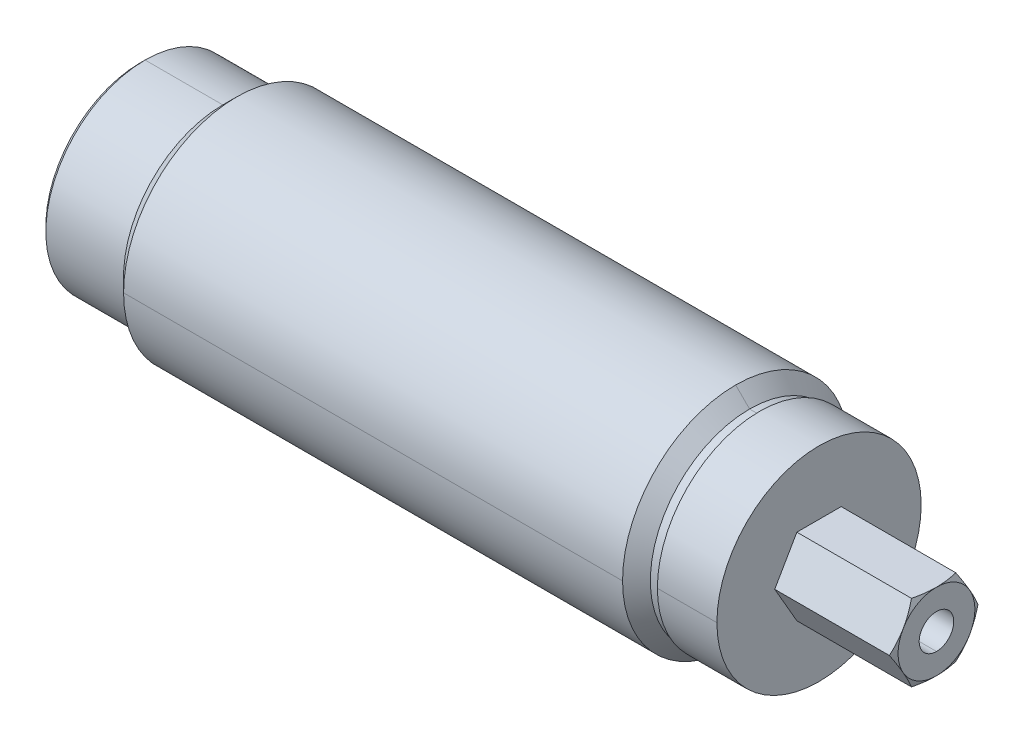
ISO-10303-21;
HEADER;
FILE_DESCRIPTION(('STEP AP214'),'2;1');
FILE_NAME('part.step','',(''),(''),'','','');
FILE_SCHEMA(('AUTOMOTIVE_DESIGN { 1 0 10303 214 1 1 1 1 }'));
ENDSEC;
DATA;
#1=APPLICATION_CONTEXT('core data for automotive mechanical design processes');
#2=APPLICATION_PROTOCOL_DEFINITION('international standard','automotive_design',2000,#1);
#3=PRODUCT_CONTEXT('',#1,'mechanical');
#4=PRODUCT('Part','Part','',(#3));
#5=PRODUCT_RELATED_PRODUCT_CATEGORY('part','',(#4));
#6=PRODUCT_DEFINITION_FORMATION('','',#4);
#7=PRODUCT_DEFINITION_CONTEXT('part definition',#1,'design');
#8=PRODUCT_DEFINITION('design','',#6,#7);
#9=PRODUCT_DEFINITION_SHAPE('','',#8);
#10=(LENGTH_UNIT() NAMED_UNIT(*) SI_UNIT(.MILLI.,.METRE.));
#11=(NAMED_UNIT(*) PLANE_ANGLE_UNIT() SI_UNIT($,.RADIAN.));
#12=(NAMED_UNIT(*) SI_UNIT($,.STERADIAN.) SOLID_ANGLE_UNIT());
#13=UNCERTAINTY_MEASURE_WITH_UNIT(LENGTH_MEASURE(1.E-05),#10,'distance_accuracy_value','');
#14=(GEOMETRIC_REPRESENTATION_CONTEXT(3) GLOBAL_UNCERTAINTY_ASSIGNED_CONTEXT((#13)) GLOBAL_UNIT_ASSIGNED_CONTEXT((#10,
#11,#12)) REPRESENTATION_CONTEXT('',''));
#15=CARTESIAN_POINT('',(0.,0.,0.));
#16=DIRECTION('',(0.,0.,1.));
#17=DIRECTION('',(1.,0.,0.));
#18=AXIS2_PLACEMENT_3D('',#15,#16,#17);
#19=CARTESIAN_POINT('',(-80.8989999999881,0.,0.));
#20=DIRECTION('',(-1.,0.,0.));
#21=DIRECTION('',(0.,0.,1.));
#22=AXIS2_PLACEMENT_3D('',#19,#20,#21);
#23=CONICAL_SURFACE('',#22,4.41960000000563,1.02974425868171);
#24=DIRECTION('',(0.515038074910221,0.857167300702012,0.));
#25=VECTOR('',#24,1.);
#26=CARTESIAN_POINT('',(-299907.692331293,-499000.,-6.11098752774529E-11));
#27=LINE('',#26,#25);
#28=CARTESIAN_POINT('',(-80.898999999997,-4.41960000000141,0.));
#29=VERTEX_POINT('',#28);
#30=CARTESIAN_POINT('',(-78.2434364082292,0.,0.));
#31=VERTEX_POINT('',#30);
#32=EDGE_CURVE('E254',#29,#31,#27,.T.);
#33=ORIENTED_EDGE('',*,*,#32,.T.);
#34=DIRECTION('',(0.515038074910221,-0.857167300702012,0.));
#35=VECTOR('',#34,1.);
#36=CARTESIAN_POINT('',(-299907.692331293,499000.,0.));
#37=LINE('',#36,#35);
#38=CARTESIAN_POINT('',(-80.898999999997,4.41960000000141,0.));
#39=VERTEX_POINT('',#38);
#40=EDGE_CURVE('E257',#31,#39,#37,.F.);
#41=ORIENTED_EDGE('',*,*,#40,.T.);
#42=CARTESIAN_POINT('',(-80.899,0.,0.));
#43=DIRECTION('',(-1.,0.,0.));
#44=DIRECTION('',(0.,0.,1.));
#45=AXIS2_PLACEMENT_3D('',#42,#43,#44);
#46=CIRCLE('',#45,4.4196);
#47=EDGE_CURVE('E245',#39,#29,#46,.T.);
#48=ORIENTED_EDGE('',*,*,#47,.T.);
#49=EDGE_LOOP('',(#33,#41,#48));
#50=FACE_BOUND('',#49,.T.);
#51=ADVANCED_FACE('F17',(#50),#23,.F.);
#52=CARTESIAN_POINT('',(-80.8989999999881,0.,0.));
#53=DIRECTION('',(-1.,0.,0.));
#54=DIRECTION('',(0.,0.,1.));
#55=AXIS2_PLACEMENT_3D('',#52,#53,#54);
#56=CONICAL_SURFACE('',#55,4.41960000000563,1.02974425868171);
#57=CARTESIAN_POINT('',(-80.899,0.,0.));
#58=DIRECTION('',(-1.,0.,0.));
#59=DIRECTION('',(0.,0.,1.));
#60=AXIS2_PLACEMENT_3D('',#57,#58,#59);
#61=CIRCLE('',#60,4.4196);
#62=EDGE_CURVE('E247',#29,#39,#61,.T.);
#63=ORIENTED_EDGE('',*,*,#62,.T.);
#64=ORIENTED_EDGE('',*,*,#40,.F.);
#65=ORIENTED_EDGE('',*,*,#32,.F.);
#66=EDGE_LOOP('',(#63,#64,#65));
#67=FACE_BOUND('',#66,.T.);
#68=ADVANCED_FACE('F838',(#67),#56,.F.);
#69=CARTESIAN_POINT('',(3.18931634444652,0.,0.));
#70=DIRECTION('',(1.,0.,0.));
#71=DIRECTION('',(0.,0.,-1.));
#72=AXIS2_PLACEMENT_3D('',#69,#70,#71);
#73=CONICAL_SURFACE('',#72,2.6542999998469,1.0821041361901);
#74=CARTESIAN_POINT('',(3.189316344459,0.,0.));
#75=DIRECTION('',(1.,0.,0.));
#76=DIRECTION('',(0.,0.,-1.));
#77=AXIS2_PLACEMENT_3D('',#74,#75,#76);
#78=CIRCLE('',#77,2.6543);
#79=CARTESIAN_POINT('',(3.18931634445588,2.65429999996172,0.));
#80=VERTEX_POINT('',#79);
#81=CARTESIAN_POINT('',(3.18931634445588,-2.65429999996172,0.));
#82=VERTEX_POINT('',#81);
#83=EDGE_CURVE('E213',#80,#82,#78,.T.);
#84=ORIENTED_EDGE('',*,*,#83,.T.);
#85=DIRECTION('',(-0.469471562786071,0.882947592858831,0.));
#86=VECTOR('',#85,1.);
#87=CARTESIAN_POINT('',(265324.784399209,-499000.,0.));
#88=LINE('',#87,#86);
#89=CARTESIAN_POINT('',(1.77800000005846,-1.98951966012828E-10,0.));
#90=VERTEX_POINT('',#89);
#91=EDGE_CURVE('E252',#82,#90,#88,.T.);
#92=ORIENTED_EDGE('',*,*,#91,.T.);
#93=DIRECTION('',(-0.469471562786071,-0.882947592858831,0.));
#94=VECTOR('',#93,1.);
#95=CARTESIAN_POINT('',(265324.784399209,499000.,-6.11098752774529E-11));
#96=LINE('',#95,#94);
#97=EDGE_CURVE('E250',#90,#80,#96,.F.);
#98=ORIENTED_EDGE('',*,*,#97,.T.);
#99=EDGE_LOOP('',(#84,#92,#98));
#100=FACE_BOUND('',#99,.T.);
#101=ADVANCED_FACE('F830',(#100),#73,.F.);
#102=CARTESIAN_POINT('',(3.18931634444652,0.,0.));
#103=DIRECTION('',(1.,0.,0.));
#104=DIRECTION('',(0.,0.,-1.));
#105=AXIS2_PLACEMENT_3D('',#102,#103,#104);
#106=CONICAL_SURFACE('',#105,2.6542999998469,1.0821041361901);
#107=ORIENTED_EDGE('',*,*,#97,.F.);
#108=ORIENTED_EDGE('',*,*,#91,.F.);
#109=CARTESIAN_POINT('',(3.189316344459,0.,0.));
#110=DIRECTION('',(1.,0.,0.));
#111=DIRECTION('',(0.,0.,-1.));
#112=AXIS2_PLACEMENT_3D('',#109,#110,#111);
#113=CIRCLE('',#112,2.6543);
#114=EDGE_CURVE('E217',#82,#80,#113,.T.);
#115=ORIENTED_EDGE('',*,*,#114,.T.);
#116=EDGE_LOOP('',(#107,#108,#115));
#117=FACE_BOUND('',#116,.T.);
#118=ADVANCED_FACE('F823',(#117),#106,.F.);
#119=CARTESIAN_POINT('',(-77.39945822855,0.,0.));
#120=DIRECTION('',(-1.,0.,0.));
#121=DIRECTION('',(0.,0.,1.));
#122=AXIS2_PLACEMENT_3D('',#119,#120,#121);
#123=CYLINDRICAL_SURFACE('',#122,4.4196);
#124=DIRECTION('',(-1.,0.,0.));
#125=VECTOR('',#124,1.);
#126=CARTESIAN_POINT('',(-77.39945822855,-4.4196,0.));
#127=LINE('',#126,#125);
#128=CARTESIAN_POINT('',(-94.246700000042,-4.41960000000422,0.));
#129=VERTEX_POINT('',#128);
#130=EDGE_CURVE('E241',#129,#29,#127,.F.);
#131=ORIENTED_EDGE('',*,*,#130,.T.);
#132=ORIENTED_EDGE('',*,*,#47,.F.);
#133=DIRECTION('',(-1.,0.,0.));
#134=VECTOR('',#133,1.);
#135=CARTESIAN_POINT('',(-77.39945822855,4.4196,0.));
#136=LINE('',#135,#134);
#137=CARTESIAN_POINT('',(-94.246700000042,4.41960000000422,0.));
#138=VERTEX_POINT('',#137);
#139=EDGE_CURVE('E243',#39,#138,#136,.T.);
#140=ORIENTED_EDGE('',*,*,#139,.T.);
#141=CARTESIAN_POINT('',(-94.246700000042,0.,0.));
#142=DIRECTION('',(-1.,0.,0.));
#143=DIRECTION('',(0.,1.,0.));
#144=AXIS2_PLACEMENT_3D('',#141,#142,#143);
#145=CIRCLE('',#144,4.41960000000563);
#146=EDGE_CURVE('E216',#138,#129,#145,.T.);
#147=ORIENTED_EDGE('',*,*,#146,.T.);
#148=EDGE_LOOP('',(#131,#132,#140,#147));
#149=FACE_BOUND('',#148,.T.);
#150=ADVANCED_FACE('F577',(#149),#123,.F.);
#151=CARTESIAN_POINT('',(-77.39945822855,0.,0.));
#152=DIRECTION('',(-1.,0.,0.));
#153=DIRECTION('',(0.,0.,1.));
#154=AXIS2_PLACEMENT_3D('',#151,#152,#153);
#155=CYLINDRICAL_SURFACE('',#154,4.4196);
#156=ORIENTED_EDGE('',*,*,#130,.F.);
#157=CARTESIAN_POINT('',(-94.246700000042,0.,0.));
#158=DIRECTION('',(-1.,0.,0.));
#159=DIRECTION('',(0.,1.,0.));
#160=AXIS2_PLACEMENT_3D('',#157,#158,#159);
#161=CIRCLE('',#160,4.41960000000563);
#162=EDGE_CURVE('E227',#129,#138,#161,.T.);
#163=ORIENTED_EDGE('',*,*,#162,.T.);
#164=ORIENTED_EDGE('',*,*,#139,.F.);
#165=ORIENTED_EDGE('',*,*,#62,.F.);
#166=EDGE_LOOP('',(#156,#163,#164,#165));
#167=FACE_BOUND('',#166,.T.);
#168=ADVANCED_FACE('F587',(#167),#155,.F.);
#169=CARTESIAN_POINT('',(0.508,0.,0.));
#170=DIRECTION('',(1.,0.,0.));
#171=DIRECTION('',(0.,0.,-1.));
#172=AXIS2_PLACEMENT_3D('',#169,#170,#171);
#173=CYLINDRICAL_SURFACE('',#172,2.6543);
#174=ORIENTED_EDGE('',*,*,#83,.F.);
#175=DIRECTION('',(1.,0.,0.));
#176=VECTOR('',#175,1.);
#177=CARTESIAN_POINT('',(0.508,2.6543,0.));
#178=LINE('',#177,#176);
#179=CARTESIAN_POINT('',(27.178,2.6543,0.));
#180=VERTEX_POINT('',#179);
#181=EDGE_CURVE('E210',#80,#180,#178,.T.);
#182=ORIENTED_EDGE('',*,*,#181,.T.);
#183=CARTESIAN_POINT('',(27.178,0.,0.));
#184=DIRECTION('',(1.,0.,0.));
#185=DIRECTION('',(0.,0.,-1.));
#186=AXIS2_PLACEMENT_3D('',#183,#184,#185);
#187=CIRCLE('',#186,2.6543);
#188=CARTESIAN_POINT('',(27.178,-2.6543,0.));
#189=VERTEX_POINT('',#188);
#190=EDGE_CURVE('E20',#189,#180,#187,.F.);
#191=ORIENTED_EDGE('',*,*,#190,.F.);
#192=DIRECTION('',(1.,0.,0.));
#193=VECTOR('',#192,1.);
#194=CARTESIAN_POINT('',(0.508,-2.6543,0.));
#195=LINE('',#194,#193);
#196=EDGE_CURVE('E222',#189,#82,#195,.F.);
#197=ORIENTED_EDGE('',*,*,#196,.T.);
#198=EDGE_LOOP('',(#174,#182,#191,#197));
#199=FACE_BOUND('',#198,.T.);
#200=ADVANCED_FACE('F212',(#199),#173,.F.);
#201=CARTESIAN_POINT('',(0.508,0.,0.));
#202=DIRECTION('',(1.,0.,0.));
#203=DIRECTION('',(0.,0.,-1.));
#204=AXIS2_PLACEMENT_3D('',#201,#202,#203);
#205=CYLINDRICAL_SURFACE('',#204,2.6543);
#206=ORIENTED_EDGE('',*,*,#114,.F.);
#207=ORIENTED_EDGE('',*,*,#196,.F.);
#208=CARTESIAN_POINT('',(27.178,0.,0.));
#209=DIRECTION('',(1.,0.,0.));
#210=DIRECTION('',(0.,0.,-1.));
#211=AXIS2_PLACEMENT_3D('',#208,#209,#210);
#212=CIRCLE('',#211,2.6543);
#213=EDGE_CURVE('E220',#180,#189,#212,.F.);
#214=ORIENTED_EDGE('',*,*,#213,.F.);
#215=ORIENTED_EDGE('',*,*,#181,.F.);
#216=EDGE_LOOP('',(#206,#207,#214,#215));
#217=FACE_BOUND('',#216,.T.);
#218=ADVANCED_FACE('F221',(#217),#205,.F.);
#219=CARTESIAN_POINT('',(-94.8435999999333,0.,0.));
#220=DIRECTION('',(-1.,0.,0.));
#221=DIRECTION('',(0.,0.,1.));
#222=AXIS2_PLACEMENT_3D('',#219,#220,#221);
#223=CONICAL_SURFACE('',#222,5.01649999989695,0.785398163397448);
#224=DIRECTION('',(0.707106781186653,0.707106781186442,0.));
#225=VECTOR('',#224,1.);
#226=CARTESIAN_POINT('',(-499000.,-498910.172899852,-6.10988746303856E-11));
#227=LINE('',#226,#225);
#228=CARTESIAN_POINT('',(-94.8435999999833,-5.01649999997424,0.));
#229=VERTEX_POINT('',#228);
#230=EDGE_CURVE('E229',#229,#129,#227,.T.);
#231=ORIENTED_EDGE('',*,*,#230,.T.);
#232=ORIENTED_EDGE('',*,*,#146,.F.);
#233=DIRECTION('',(0.707106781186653,-0.707106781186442,0.));
#234=VECTOR('',#233,1.);
#235=CARTESIAN_POINT('',(-499000.,498910.172899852,0.));
#236=LINE('',#235,#234);
#237=CARTESIAN_POINT('',(-94.8435999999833,5.01649999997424,0.));
#238=VERTEX_POINT('',#237);
#239=EDGE_CURVE('E237',#138,#238,#236,.F.);
#240=ORIENTED_EDGE('',*,*,#239,.T.);
#241=CARTESIAN_POINT('',(-94.8436,0.,0.));
#242=DIRECTION('',(-1.,0.,0.));
#243=DIRECTION('',(0.,0.,1.));
#244=AXIS2_PLACEMENT_3D('',#241,#242,#243);
#245=CIRCLE('',#244,5.0165);
#246=EDGE_CURVE('E224',#238,#229,#245,.T.);
#247=ORIENTED_EDGE('',*,*,#246,.T.);
#248=EDGE_LOOP('',(#231,#232,#240,#247));
#249=FACE_BOUND('',#248,.T.);
#250=ADVANCED_FACE('F582',(#249),#223,.F.);
#251=CARTESIAN_POINT('',(-94.8435999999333,0.,0.));
#252=DIRECTION('',(-1.,0.,0.));
#253=DIRECTION('',(0.,0.,1.));
#254=AXIS2_PLACEMENT_3D('',#251,#252,#253);
#255=CONICAL_SURFACE('',#254,5.01649999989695,0.785398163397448);
#256=ORIENTED_EDGE('',*,*,#230,.F.);
#257=CARTESIAN_POINT('',(-94.8436,0.,0.));
#258=DIRECTION('',(-1.,0.,0.));
#259=DIRECTION('',(0.,0.,1.));
#260=AXIS2_PLACEMENT_3D('',#257,#258,#259);
#261=CIRCLE('',#260,5.0165);
#262=EDGE_CURVE('E568',#229,#238,#261,.T.);
#263=ORIENTED_EDGE('',*,*,#262,.T.);
#264=ORIENTED_EDGE('',*,*,#239,.F.);
#265=ORIENTED_EDGE('',*,*,#162,.F.);
#266=EDGE_LOOP('',(#256,#263,#264,#265));
#267=FACE_BOUND('',#266,.T.);
#268=ADVANCED_FACE('F588',(#267),#255,.F.);
#269=CARTESIAN_POINT('',(27.178,0.,0.));
#270=DIRECTION('',(1.,0.,0.));
#271=DIRECTION('',(0.,0.,-1.));
#272=AXIS2_PLACEMENT_3D('',#269,#270,#271);
#273=PLANE('',#272);
#274=ORIENTED_EDGE('',*,*,#190,.T.);
#275=ORIENTED_EDGE('',*,*,#213,.T.);
#276=EDGE_LOOP('',(#274,#275));
#277=FACE_BOUND('',#276,.T.);
#278=CARTESIAN_POINT('',(27.1780000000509,0.,0.));
#279=DIRECTION('',(-1.,0.,0.));
#280=DIRECTION('',(0.,0.,1.));
#281=AXIS2_PLACEMENT_3D('',#278,#279,#280);
#282=CIRCLE('',#281,5.89299999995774);
#283=CARTESIAN_POINT('',(27.1780000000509,2.94649999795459,-5.10348770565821));
#284=VERTEX_POINT('',#283);
#285=CARTESIAN_POINT('',(27.1780000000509,-2.94649999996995,-5.10348770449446));
#286=VERTEX_POINT('',#285);
#287=EDGE_CURVE('E613',#284,#286,#282,.T.);
#288=ORIENTED_EDGE('',*,*,#287,.F.);
#289=CARTESIAN_POINT('',(27.1780000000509,0.,0.));
#290=DIRECTION('',(-1.,0.,0.));
#291=DIRECTION('',(0.,0.,1.));
#292=AXIS2_PLACEMENT_3D('',#289,#290,#291);
#293=CIRCLE('',#292,5.89299999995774);
#294=CARTESIAN_POINT('',(27.1780000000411,5.89299999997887,0.));
#295=VERTEX_POINT('',#294);
#296=EDGE_CURVE('E572',#295,#284,#293,.T.);
#297=ORIENTED_EDGE('',*,*,#296,.F.);
#298=CARTESIAN_POINT('',(27.1780000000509,0.,0.));
#299=DIRECTION('',(-1.,0.,0.));
#300=DIRECTION('',(0.,0.,1.));
#301=AXIS2_PLACEMENT_3D('',#298,#299,#300);
#302=CIRCLE('',#301,5.89299999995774);
#303=CARTESIAN_POINT('',(27.1780000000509,2.94649999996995,5.10348770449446));
#304=VERTEX_POINT('',#303);
#305=EDGE_CURVE('E604',#304,#295,#302,.T.);
#306=ORIENTED_EDGE('',*,*,#305,.F.);
#307=CARTESIAN_POINT('',(27.1780000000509,0.,0.));
#308=DIRECTION('',(-1.,0.,0.));
#309=DIRECTION('',(0.,0.,1.));
#310=AXIS2_PLACEMENT_3D('',#307,#308,#309);
#311=CIRCLE('',#310,5.89299999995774);
#312=CARTESIAN_POINT('',(27.1780000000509,-2.94649996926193,5.10348772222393));
#313=VERTEX_POINT('',#312);
#314=EDGE_CURVE('E599',#313,#304,#311,.T.);
#315=ORIENTED_EDGE('',*,*,#314,.F.);
#316=CARTESIAN_POINT('',(27.1780000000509,0.,0.));
#317=DIRECTION('',(-1.,0.,0.));
#318=DIRECTION('',(0.,0.,1.));
#319=AXIS2_PLACEMENT_3D('',#316,#317,#318);
#320=CIRCLE('',#319,5.89299999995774);
#321=CARTESIAN_POINT('',(27.1780000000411,-5.89299999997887,0.));
#322=VERTEX_POINT('',#321);
#323=EDGE_CURVE('E607',#322,#313,#320,.T.);
#324=ORIENTED_EDGE('',*,*,#323,.F.);
#325=CARTESIAN_POINT('',(27.1780000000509,0.,0.));
#326=DIRECTION('',(-1.,0.,0.));
#327=DIRECTION('',(0.,0.,1.));
#328=AXIS2_PLACEMENT_3D('',#325,#326,#327);
#329=CIRCLE('',#328,5.89299999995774);
#330=EDGE_CURVE('E610',#286,#322,#329,.T.);
#331=ORIENTED_EDGE('',*,*,#330,.F.);
#332=EDGE_LOOP('',(#288,#297,#306,#315,#324,#331));
#333=FACE_BOUND('',#332,.T.);
#334=ADVANCED_FACE('F225',(#277,#333),#273,.T.);
#335=CARTESIAN_POINT('',(-77.39945822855,0.,0.));
#336=DIRECTION('',(-1.,0.,0.));
#337=DIRECTION('',(0.,0.,1.));
#338=AXIS2_PLACEMENT_3D('',#335,#336,#337);
#339=CYLINDRICAL_SURFACE('',#338,5.0165);
#340=DIRECTION('',(-1.,0.,0.));
#341=VECTOR('',#340,1.);
#342=CARTESIAN_POINT('',(-77.39945822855,-5.0165,0.));
#343=LINE('',#342,#341);
#344=CARTESIAN_POINT('',(-94.869,-5.0165,0.));
#345=VERTEX_POINT('',#344);
#346=EDGE_CURVE('E565',#345,#229,#343,.F.);
#347=ORIENTED_EDGE('',*,*,#346,.T.);
#348=ORIENTED_EDGE('',*,*,#246,.F.);
#349=DIRECTION('',(-1.,0.,0.));
#350=VECTOR('',#349,1.);
#351=CARTESIAN_POINT('',(-77.39945822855,5.0165,0.));
#352=LINE('',#351,#350);
#353=CARTESIAN_POINT('',(-94.869,5.0165,0.));
#354=VERTEX_POINT('',#353);
#355=EDGE_CURVE('E563',#238,#354,#352,.T.);
#356=ORIENTED_EDGE('',*,*,#355,.T.);
#357=CARTESIAN_POINT('',(-94.869,0.,0.));
#358=DIRECTION('',(-1.,0.,0.));
#359=DIRECTION('',(0.,0.,1.));
#360=AXIS2_PLACEMENT_3D('',#357,#358,#359);
#361=CIRCLE('',#360,5.0165);
#362=EDGE_CURVE('E595',#345,#354,#361,.F.);
#363=ORIENTED_EDGE('',*,*,#362,.F.);
#364=EDGE_LOOP('',(#347,#348,#356,#363));
#365=FACE_BOUND('',#364,.T.);
#366=ADVANCED_FACE('F591',(#365),#339,.F.);
#367=CARTESIAN_POINT('',(-77.39945822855,0.,0.));
#368=DIRECTION('',(-1.,0.,0.));
#369=DIRECTION('',(0.,0.,1.));
#370=AXIS2_PLACEMENT_3D('',#367,#368,#369);
#371=CYLINDRICAL_SURFACE('',#370,5.0165);
#372=ORIENTED_EDGE('',*,*,#346,.F.);
#373=CARTESIAN_POINT('',(-94.869,0.,0.));
#374=DIRECTION('',(-1.,0.,0.));
#375=DIRECTION('',(0.,0.,1.));
#376=AXIS2_PLACEMENT_3D('',#373,#374,#375);
#377=CIRCLE('',#376,5.0165);
#378=EDGE_CURVE('E598',#354,#345,#377,.F.);
#379=ORIENTED_EDGE('',*,*,#378,.F.);
#380=ORIENTED_EDGE('',*,*,#355,.F.);
#381=ORIENTED_EDGE('',*,*,#262,.F.);
#382=EDGE_LOOP('',(#372,#379,#380,#381));
#383=FACE_BOUND('',#382,.T.);
#384=ADVANCED_FACE('F412',(#383),#371,.F.);
#385=CARTESIAN_POINT('',(26.7503398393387,0.,0.));
#386=DIRECTION('',(-1.,0.,0.));
#387=DIRECTION('',(0.,0.,1.));
#388=AXIS2_PLACEMENT_3D('',#385,#386,#387);
#389=CONICAL_SURFACE('',#388,6.8101201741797,1.13446401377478);
#390=CARTESIAN_POINT('',(26.7528904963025,5.89300000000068,-3.40232513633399));
#391=CARTESIAN_POINT('',(26.8179984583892,5.65125142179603,-3.54189874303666));
#392=CARTESIAN_POINT('',(26.8774167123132,5.40820032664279,-3.68222435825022));
#393=CARTESIAN_POINT('',(26.9820096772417,4.92067444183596,-3.96369755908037));
#394=CARTESIAN_POINT('',(27.0272315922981,4.6762071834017,-4.10484079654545));
#395=CARTESIAN_POINT('',(27.0826045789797,4.30799772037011,-4.31742662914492));
#396=CARTESIAN_POINT('',(27.0989899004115,4.18495724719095,-4.38846407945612));
#397=CARTESIAN_POINT('',(27.1273203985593,3.93849223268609,-4.53076072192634));
#398=CARTESIAN_POINT('',(27.1392656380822,3.81506769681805,-4.60201991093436));
#399=CARTESIAN_POINT('',(27.1585160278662,3.56753192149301,-4.74493475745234));
#400=CARTESIAN_POINT('',(27.1658055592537,3.44341976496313,-4.81659094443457));
#401=CARTESIAN_POINT('',(27.1755563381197,3.19503958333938,-4.95999330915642));
#402=CARTESIAN_POINT('',(27.178017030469,3.0707715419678,-5.03173949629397));
#403=CARTESIAN_POINT('',(27.1780000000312,2.94649999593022,-5.10348770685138));
#404=B_SPLINE_CURVE_WITH_KNOTS('',3,(#390,#391,#392,#393,#394,#395,#396,#397,#398,#399,#400,
#401,#402,#403),.UNSPECIFIED.,.F.,.F.,(4,2,2,2,2,2,4),(0.,0.860135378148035,1.71737967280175,
2.14636621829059,2.57534669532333,3.00575885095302,3.43622048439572),.UNSPECIFIED.);
#405=CARTESIAN_POINT('',(26.7528904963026,5.89300000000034,-3.40232513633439));
#406=VERTEX_POINT('',#405);
#407=EDGE_CURVE('E394',#406,#284,#404,.T.);
#408=ORIENTED_EDGE('',*,*,#407,.F.);
#409=CARTESIAN_POINT('',(27.1780000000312,5.893,0.));
#410=CARTESIAN_POINT('',(27.1780170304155,5.893,-0.143496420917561));
#411=CARTESIAN_POINT('',(27.1755563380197,5.893,-0.286988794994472));
#412=CARTESIAN_POINT('',(27.1658055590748,5.893,-0.573793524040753));
#413=CARTESIAN_POINT('',(27.158516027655,5.893,-0.717105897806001));
#414=CARTESIAN_POINT('',(27.1392656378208,5.893,-1.0029355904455));
#415=CARTESIAN_POINT('',(27.1273203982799,5.893,-1.1454539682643));
#416=CARTESIAN_POINT('',(27.0989899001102,5.893,-1.43004725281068));
#417=CARTESIAN_POINT('',(27.0826045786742,5.893,-1.5721221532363));
#418=CARTESIAN_POINT('',(27.0272315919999,5.893,-1.99729381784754));
#419=CARTESIAN_POINT('',(26.9820096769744,5.893,-2.27958029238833));
#420=CARTESIAN_POINT('',(26.8774167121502,5.893,-2.84252669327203));
#421=CARTESIAN_POINT('',(26.8179984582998,5.893,-3.12317792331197));
#422=CARTESIAN_POINT('',(26.7528904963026,5.893,-3.40232513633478));
#423=B_SPLINE_CURVE_WITH_KNOTS('',3,(#409,#410,#411,#412,#413,#414,#415,#416,#417,#418,#419,
#420,#421,#422),.UNSPECIFIED.,.F.,.F.,(4,2,2,2,2,2,4),(0.,0.430461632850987,0.86087378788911,
1.28985426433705,1.71884080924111,2.57608510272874,3.43622047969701),.UNSPECIFIED.);
#424=EDGE_CURVE('E416',#295,#406,#423,.T.);
#425=ORIENTED_EDGE('',*,*,#424,.F.);
#426=ORIENTED_EDGE('',*,*,#296,.T.);
#427=EDGE_LOOP('',(#408,#425,#426));
#428=FACE_BOUND('',#427,.T.);
#429=ADVANCED_FACE('F408',(#428),#389,.T.);
#430=CARTESIAN_POINT('',(26.7503398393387,0.,0.));
#431=DIRECTION('',(-1.,0.,0.));
#432=DIRECTION('',(0.,0.,1.));
#433=AXIS2_PLACEMENT_3D('',#430,#431,#432);
#434=CONICAL_SURFACE('',#433,6.8101201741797,1.13446401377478);
#435=CARTESIAN_POINT('',(26.7528904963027,7.01271046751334E-13,-6.80465027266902));
#436=CARTESIAN_POINT('',(26.817998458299,-0.241748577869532,-6.66507666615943));
#437=CARTESIAN_POINT('',(26.8774167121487,-0.484799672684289,-6.52475105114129));
#438=CARTESIAN_POINT('',(26.982009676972,-0.972325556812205,-6.24327785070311));
#439=CARTESIAN_POINT('',(27.0272315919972,-1.21679281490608,-6.10213461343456));
#440=CARTESIAN_POINT('',(27.0826045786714,-1.58500227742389,-5.88954878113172));
#441=CARTESIAN_POINT('',(27.0989899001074,-1.708042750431,-5.81851133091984));
#442=CARTESIAN_POINT('',(27.1273203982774,-1.95450776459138,-5.67621468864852));
#443=CARTESIAN_POINT('',(27.1392656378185,-2.07793230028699,-5.60495549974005));
#444=CARTESIAN_POINT('',(27.1585160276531,-2.32546807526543,-5.46204065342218));
#445=CARTESIAN_POINT('',(27.1658055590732,-2.44958023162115,-5.3903844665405));
#446=CARTESIAN_POINT('',(27.1755563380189,-2.69796041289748,-5.24698210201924));
#447=CARTESIAN_POINT('',(27.1780170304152,-2.82222845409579,-5.17523591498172));
#448=CARTESIAN_POINT('',(27.1780000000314,-2.94649999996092,-5.10348770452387));
#449=B_SPLINE_CURVE_WITH_KNOTS('',3,(#435,#436,#437,#438,#439,#440,#441,#442,#443,#444,#445,
#446,#447,#448),.UNSPECIFIED.,.F.,.F.,(4,2,2,2,2,2,4),(0.,0.860135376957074,1.71737967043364,
2.14636621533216,2.57534669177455,3.00575884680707,3.43622047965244),.UNSPECIFIED.);
#450=CARTESIAN_POINT('',(26.7528904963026,1.67467146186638E-13,-6.80465027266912));
#451=VERTEX_POINT('',#450);
#452=EDGE_CURVE('E369',#451,#286,#449,.T.);
#453=ORIENTED_EDGE('',*,*,#452,.F.);
#454=CARTESIAN_POINT('',(27.1780000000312,2.94649999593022,-5.10348770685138));
#455=CARTESIAN_POINT('',(27.178017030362,2.82222845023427,-5.17523591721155));
#456=CARTESIAN_POINT('',(27.1755563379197,2.69796040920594,-5.24698210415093));
#457=CARTESIAN_POINT('',(27.1658055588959,2.44958022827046,-5.3903844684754));
#458=CARTESIAN_POINT('',(27.1585160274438,2.32546807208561,-5.46204065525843));
#459=CARTESIAN_POINT('',(27.1392656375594,2.07793229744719,-5.60495550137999));
#460=CARTESIAN_POINT('',(27.1273203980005,1.95450776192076,-5.67621469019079));
#461=CARTESIAN_POINT('',(27.0989898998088,1.70804274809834,-5.81851133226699));
#462=CARTESIAN_POINT('',(27.0826045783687,1.58500227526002,-5.88954878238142));
#463=CARTESIAN_POINT('',(27.0272315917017,1.21679281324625,-6.10213461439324));
#464=CARTESIAN_POINT('',(26.9820096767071,0.972325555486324,-6.24327785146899));
#465=CARTESIAN_POINT('',(26.8774167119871,0.484799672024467,-6.52475105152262));
#466=CARTESIAN_POINT('',(26.8179984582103,0.241748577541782,-6.66507666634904));
#467=CARTESIAN_POINT('',(26.7528904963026,-3.66555037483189E-13,-6.80465027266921));
#468=B_SPLINE_CURVE_WITH_KNOTS('',3,(#454,#455,#456,#457,#458,#459,#460,#461,#462,#463,#464,
#465,#466,#467),.UNSPECIFIED.,.F.,.F.,(4,2,2,2,2,2,4),(0.,0.430461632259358,0.860873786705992,
1.28985426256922,1.71884080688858,2.57608509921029,3.43622047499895),.UNSPECIFIED.);
#469=EDGE_CURVE('E401',#284,#451,#468,.T.);
#470=ORIENTED_EDGE('',*,*,#469,.F.);
#471=ORIENTED_EDGE('',*,*,#287,.T.);
#472=EDGE_LOOP('',(#453,#470,#471));
#473=FACE_BOUND('',#472,.T.);
#474=ADVANCED_FACE('F383',(#473),#434,.T.);
#475=CARTESIAN_POINT('',(26.7503398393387,0.,0.));
#476=DIRECTION('',(-1.,0.,0.));
#477=DIRECTION('',(0.,0.,1.));
#478=AXIS2_PLACEMENT_3D('',#475,#476,#477);
#479=CONICAL_SURFACE('',#478,6.8101201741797,1.13446401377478);
#480=CARTESIAN_POINT('',(26.7528904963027,-5.893,-3.40232513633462));
#481=CARTESIAN_POINT('',(26.8179984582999,-5.893,-3.12317792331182));
#482=CARTESIAN_POINT('',(26.8774167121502,-5.893,-2.84252669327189));
#483=CARTESIAN_POINT('',(26.9820096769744,-5.893,-2.27958029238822));
#484=CARTESIAN_POINT('',(27.0272315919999,-5.893,-1.99729381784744));
#485=CARTESIAN_POINT('',(27.0826045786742,-5.893,-1.57212215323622));
#486=CARTESIAN_POINT('',(27.0989899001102,-5.893,-1.43004725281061));
#487=CARTESIAN_POINT('',(27.1273203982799,-5.893,-1.14545396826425));
#488=CARTESIAN_POINT('',(27.1392656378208,-5.893,-1.00293559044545));
#489=CARTESIAN_POINT('',(27.158516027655,-5.893,-0.717105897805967));
#490=CARTESIAN_POINT('',(27.1658055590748,-5.893,-0.573793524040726));
#491=CARTESIAN_POINT('',(27.1755563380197,-5.893,-0.286988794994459));
#492=CARTESIAN_POINT('',(27.1780170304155,-5.893,-0.143496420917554));
#493=CARTESIAN_POINT('',(27.1780000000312,-5.893,0.));
#494=B_SPLINE_CURVE_WITH_KNOTS('',3,(#480,#481,#482,#483,#484,#485,#486,#487,#488,#489,#490,
#491,#492,#493),.UNSPECIFIED.,.F.,.F.,(4,2,2,2,2,2,4),(0.,0.860135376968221,1.71737967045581,
2.14636621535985,2.57534669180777,3.00575884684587,3.43622047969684),.UNSPECIFIED.);
#495=CARTESIAN_POINT('',(26.7528904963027,-5.89300000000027,-3.40232513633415));
#496=VERTEX_POINT('',#495);
#497=EDGE_CURVE('E338',#496,#322,#494,.T.);
#498=ORIENTED_EDGE('',*,*,#497,.F.);
#499=CARTESIAN_POINT('',(27.1780000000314,-2.94649999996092,-5.10348770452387));
#500=CARTESIAN_POINT('',(27.1780170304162,-3.07077154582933,-5.03173949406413));
#501=CARTESIAN_POINT('',(27.1755563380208,-3.19503958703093,-4.95999330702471));
#502=CARTESIAN_POINT('',(27.1658055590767,-3.44341976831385,-4.81659094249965));
#503=CARTESIAN_POINT('',(27.1585160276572,-3.56753192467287,-4.74493475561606));
#504=CARTESIAN_POINT('',(27.1392656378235,-3.8150676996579,-4.60201990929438));
#505=CARTESIAN_POINT('',(27.1273203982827,-3.93849223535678,-4.53076072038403));
#506=CARTESIAN_POINT('',(27.0989899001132,-4.18495724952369,-4.38846407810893));
#507=CARTESIAN_POINT('',(27.0826045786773,-4.30799772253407,-4.31742662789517));
#508=CARTESIAN_POINT('',(27.0272315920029,-4.67620718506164,-4.1048407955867));
#509=CARTESIAN_POINT('',(26.9820096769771,-4.92067444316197,-3.96369755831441));
#510=CARTESIAN_POINT('',(26.8774167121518,-5.40820032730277,-3.6822243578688));
#511=CARTESIAN_POINT('',(26.8179984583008,-5.65125142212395,-3.54189874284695));
#512=CARTESIAN_POINT('',(26.7528904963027,-5.89300000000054,-3.40232513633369));
#513=B_SPLINE_CURVE_WITH_KNOTS('',3,(#499,#500,#501,#502,#503,#504,#505,#506,#507,#508,#509,
#510,#511,#512),.UNSPECIFIED.,.F.,.F.,(4,2,2,2,2,2,4),(0.,0.430461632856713,0.86087378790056,
1.28985426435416,1.71884080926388,2.57608510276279,3.43622047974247),.UNSPECIFIED.);
#514=EDGE_CURVE('E388',#286,#496,#513,.T.);
#515=ORIENTED_EDGE('',*,*,#514,.F.);
#516=ORIENTED_EDGE('',*,*,#330,.T.);
#517=EDGE_LOOP('',(#498,#515,#516));
#518=FACE_BOUND('',#517,.T.);
#519=ADVANCED_FACE('F378',(#518),#479,.T.);
#520=CARTESIAN_POINT('',(26.7503398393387,0.,0.));
#521=DIRECTION('',(-1.,0.,0.));
#522=DIRECTION('',(0.,0.,1.));
#523=AXIS2_PLACEMENT_3D('',#520,#521,#522);
#524=CONICAL_SURFACE('',#523,6.8101201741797,1.13446401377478);
#525=CARTESIAN_POINT('',(26.7528904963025,-5.89300000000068,3.40232513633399));
#526=CARTESIAN_POINT('',(26.8179984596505,-5.65125141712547,3.54189874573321));
#527=CARTESIAN_POINT('',(26.8774167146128,-5.40820031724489,3.6822243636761));
#528=CARTESIAN_POINT('',(26.9820096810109,-4.92067442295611,3.96369756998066));
#529=CARTESIAN_POINT('',(27.0272315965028,-4.67620715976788,4.10484081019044));
#530=CARTESIAN_POINT('',(27.0826045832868,-4.30799768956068,4.31742664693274));
#531=CARTESIAN_POINT('',(27.0989899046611,-4.18495721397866,4.38846409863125));
#532=CARTESIAN_POINT('',(27.1273204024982,-3.93849219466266,4.53076074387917));
#533=CARTESIAN_POINT('',(27.1392656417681,-3.81506765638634,4.60201993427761));
#534=CARTESIAN_POINT('',(27.1585160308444,-3.56753187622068,4.74493478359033));
#535=CARTESIAN_POINT('',(27.1658055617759,-3.44341971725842,4.8165909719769));
#536=CARTESIAN_POINT('',(27.1755563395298,-3.19503953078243,4.95999333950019));
#537=CARTESIAN_POINT('',(27.1780170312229,-3.07077148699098,5.03173952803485));
#538=CARTESIAN_POINT('',(27.1780000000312,-2.94649993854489,5.10348773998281));
#539=B_SPLINE_CURVE_WITH_KNOTS('',3,(#525,#526,#527,#528,#529,#530,#531,#532,#533,#534,#535,
#536,#537,#538),.UNSPECIFIED.,.F.,.F.,(4,2,2,2,2,2,4),(0.,0.860135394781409,1.71737970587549,
2.14636625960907,2.57534674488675,3.00575890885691,3.43622055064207),.UNSPECIFIED.);
#540=CARTESIAN_POINT('',(26.7528904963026,-5.89300000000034,3.40232513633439));
#541=VERTEX_POINT('',#540);
#542=EDGE_CURVE('E339',#541,#313,#539,.T.);
#543=ORIENTED_EDGE('',*,*,#542,.F.);
#544=CARTESIAN_POINT('',(27.1780000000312,-5.893,0.));
#545=CARTESIAN_POINT('',(27.1780170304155,-5.893,0.143496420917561));
#546=CARTESIAN_POINT('',(27.1755563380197,-5.893,0.286988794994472));
#547=CARTESIAN_POINT('',(27.1658055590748,-5.893,0.573793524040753));
#548=CARTESIAN_POINT('',(27.158516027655,-5.893,0.717105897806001));
#549=CARTESIAN_POINT('',(27.1392656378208,-5.893,1.0029355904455));
#550=CARTESIAN_POINT('',(27.1273203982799,-5.893,1.1454539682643));
#551=CARTESIAN_POINT('',(27.0989899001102,-5.893,1.43004725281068));
#552=CARTESIAN_POINT('',(27.0826045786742,-5.893,1.5721221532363));
#553=CARTESIAN_POINT('',(27.0272315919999,-5.893,1.99729381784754));
#554=CARTESIAN_POINT('',(26.9820096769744,-5.893,2.27958029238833));
#555=CARTESIAN_POINT('',(26.8774167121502,-5.893,2.84252669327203));
#556=CARTESIAN_POINT('',(26.8179984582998,-5.893,3.12317792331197));
#557=CARTESIAN_POINT('',(26.7528904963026,-5.893,3.40232513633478));
#558=B_SPLINE_CURVE_WITH_KNOTS('',3,(#544,#545,#546,#547,#548,#549,#550,#551,#552,#553,#554,
#555,#556,#557),.UNSPECIFIED.,.F.,.F.,(4,2,2,2,2,2,4),(0.,0.430461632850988,0.86087378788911,
1.28985426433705,1.71884080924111,2.57608510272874,3.43622047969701),.UNSPECIFIED.);
#559=EDGE_CURVE('E363',#322,#541,#558,.T.);
#560=ORIENTED_EDGE('',*,*,#559,.F.);
#561=ORIENTED_EDGE('',*,*,#323,.T.);
#562=EDGE_LOOP('',(#543,#560,#561));
#563=FACE_BOUND('',#562,.T.);
#564=ADVANCED_FACE('F375',(#563),#524,.T.);
#565=CARTESIAN_POINT('',(26.7503398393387,0.,0.));
#566=DIRECTION('',(-1.,0.,0.));
#567=DIRECTION('',(0.,0.,1.));
#568=AXIS2_PLACEMENT_3D('',#565,#566,#567);
#569=CONICAL_SURFACE('',#568,6.8101201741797,1.13446401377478);
#570=CARTESIAN_POINT('',(26.7528904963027,5.893,3.40232513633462));
#571=CARTESIAN_POINT('',(26.8179984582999,5.893,3.12317792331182));
#572=CARTESIAN_POINT('',(26.8774167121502,5.893,2.84252669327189));
#573=CARTESIAN_POINT('',(26.9820096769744,5.893,2.27958029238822));
#574=CARTESIAN_POINT('',(27.0272315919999,5.893,1.99729381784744));
#575=CARTESIAN_POINT('',(27.0826045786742,5.893,1.57212215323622));
#576=CARTESIAN_POINT('',(27.0989899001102,5.893,1.43004725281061));
#577=CARTESIAN_POINT('',(27.1273203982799,5.893,1.14545396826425));
#578=CARTESIAN_POINT('',(27.1392656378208,5.893,1.00293559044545));
#579=CARTESIAN_POINT('',(27.158516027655,5.893,0.717105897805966));
#580=CARTESIAN_POINT('',(27.1658055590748,5.893,0.573793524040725));
#581=CARTESIAN_POINT('',(27.1755563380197,5.893,0.286988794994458));
#582=CARTESIAN_POINT('',(27.1780170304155,5.893,0.143496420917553));
#583=CARTESIAN_POINT('',(27.1780000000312,5.893,0.));
#584=B_SPLINE_CURVE_WITH_KNOTS('',3,(#570,#571,#572,#573,#574,#575,#576,#577,#578,#579,#580,
#581,#582,#583),.UNSPECIFIED.,.F.,.F.,(4,2,2,2,2,2,4),(0.,0.860135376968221,1.71737967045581,
2.14636621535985,2.57534669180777,3.00575884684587,3.43622047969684),.UNSPECIFIED.);
#585=CARTESIAN_POINT('',(26.7528904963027,5.893,3.40232513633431));
#586=VERTEX_POINT('',#585);
#587=EDGE_CURVE('E421',#586,#295,#584,.T.);
#588=ORIENTED_EDGE('',*,*,#587,.F.);
#589=CARTESIAN_POINT('',(27.1780000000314,2.94649999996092,5.10348770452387));
#590=CARTESIAN_POINT('',(27.1780170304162,3.07077154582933,5.03173949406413));
#591=CARTESIAN_POINT('',(27.1755563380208,3.19503958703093,4.95999330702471));
#592=CARTESIAN_POINT('',(27.1658055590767,3.44341976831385,4.81659094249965));
#593=CARTESIAN_POINT('',(27.1585160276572,3.56753192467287,4.74493475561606));
#594=CARTESIAN_POINT('',(27.1392656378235,3.8150676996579,4.60201990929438));
#595=CARTESIAN_POINT('',(27.1273203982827,3.93849223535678,4.53076072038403));
#596=CARTESIAN_POINT('',(27.0989899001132,4.18495724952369,4.38846407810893));
#597=CARTESIAN_POINT('',(27.0826045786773,4.30799772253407,4.31742662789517));
#598=CARTESIAN_POINT('',(27.0272315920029,4.67620718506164,4.1048407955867));
#599=CARTESIAN_POINT('',(26.9820096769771,4.92067444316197,3.96369755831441));
#600=CARTESIAN_POINT('',(26.8774167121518,5.40820032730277,3.6822243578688));
#601=CARTESIAN_POINT('',(26.8179984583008,5.65125142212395,3.54189874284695));
#602=CARTESIAN_POINT('',(26.7528904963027,5.89300000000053,3.40232513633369));
#603=B_SPLINE_CURVE_WITH_KNOTS('',3,(#589,#590,#591,#592,#593,#594,#595,#596,#597,#598,#599,
#600,#601,#602),.UNSPECIFIED.,.F.,.F.,(4,2,2,2,2,2,4),(0.,0.430461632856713,0.860873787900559,
1.28985426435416,1.71884080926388,2.57608510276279,3.43622047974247),.UNSPECIFIED.);
#604=EDGE_CURVE('E310',#304,#586,#603,.T.);
#605=ORIENTED_EDGE('',*,*,#604,.F.);
#606=ORIENTED_EDGE('',*,*,#305,.T.);
#607=EDGE_LOOP('',(#588,#605,#606));
#608=FACE_BOUND('',#607,.T.);
#609=ADVANCED_FACE('F325',(#608),#569,.T.);
#610=CARTESIAN_POINT('',(26.7503398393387,0.,0.));
#611=DIRECTION('',(-1.,0.,0.));
#612=DIRECTION('',(0.,0.,1.));
#613=AXIS2_PLACEMENT_3D('',#610,#611,#612);
#614=CONICAL_SURFACE('',#613,6.8101201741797,1.13446401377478);
#615=CARTESIAN_POINT('',(26.7528904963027,-6.77544897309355E-13,6.80465027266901));
#616=CARTESIAN_POINT('',(26.817998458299,0.241748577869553,6.66507666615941));
#617=CARTESIAN_POINT('',(26.8774167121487,0.484799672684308,6.52475105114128));
#618=CARTESIAN_POINT('',(26.982009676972,0.972325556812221,6.2432778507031));
#619=CARTESIAN_POINT('',(27.0272315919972,1.21679281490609,6.10213461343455));
#620=CARTESIAN_POINT('',(27.0826045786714,1.5850022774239,5.88954878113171));
#621=CARTESIAN_POINT('',(27.0989899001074,1.70804275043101,5.81851133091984));
#622=CARTESIAN_POINT('',(27.1273203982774,1.95450776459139,5.67621468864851));
#623=CARTESIAN_POINT('',(27.1392656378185,2.07793230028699,5.60495549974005));
#624=CARTESIAN_POINT('',(27.1585160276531,2.32546807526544,5.46204065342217));
#625=CARTESIAN_POINT('',(27.1658055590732,2.44958023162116,5.39038446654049));
#626=CARTESIAN_POINT('',(27.1755563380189,2.69796041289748,5.24698210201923));
#627=CARTESIAN_POINT('',(27.1780170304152,2.82222845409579,5.17523591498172));
#628=CARTESIAN_POINT('',(27.1780000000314,2.94649999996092,5.10348770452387));
#629=B_SPLINE_CURVE_WITH_KNOTS('',3,(#615,#616,#617,#618,#619,#620,#621,#622,#623,#624,#625,
#626,#627,#628),.UNSPECIFIED.,.F.,.F.,(4,2,2,2,2,2,4),(0.,0.860135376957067,1.71737967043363,
2.14636621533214,2.57534669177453,3.00575884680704,3.43622047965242),.UNSPECIFIED.);
#630=CARTESIAN_POINT('',(26.7528904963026,-1.4366188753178E-13,6.80465027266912));
#631=VERTEX_POINT('',#630);
#632=EDGE_CURVE('E301',#631,#304,#629,.T.);
#633=ORIENTED_EDGE('',*,*,#632,.F.);
#634=CARTESIAN_POINT('',(27.1780000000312,-2.94649993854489,5.10348773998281));
#635=CARTESIAN_POINT('',(27.1780170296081,-2.82222839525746,5.17523594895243));
#636=CARTESIAN_POINT('',(27.1755563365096,-2.69796035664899,5.2469821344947));
#637=CARTESIAN_POINT('',(27.1658055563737,-2.44958018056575,5.39038449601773));
#638=CARTESIAN_POINT('',(27.1585160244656,-2.32546802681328,5.46204068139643));
#639=CARTESIAN_POINT('',(27.1392656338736,-2.07793225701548,5.60495552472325));
#640=CARTESIAN_POINT('',(27.1273203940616,-1.95450772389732,5.67621471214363));
#641=CARTESIAN_POINT('',(27.0989898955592,-1.70804271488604,5.81851135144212));
#642=CARTESIAN_POINT('',(27.0826045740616,-1.58500224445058,5.88954880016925));
#643=CARTESIAN_POINT('',(27.027231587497,-1.21679278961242,6.10213462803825));
#644=CARTESIAN_POINT('',(26.9820096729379,-0.972325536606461,6.24327786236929));
#645=CARTESIAN_POINT('',(26.8774167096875,-0.484799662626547,6.52475105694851));
#646=CARTESIAN_POINT('',(26.8179984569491,-0.241748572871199,6.6650766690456));
#647=CARTESIAN_POINT('',(26.7528904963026,3.90331451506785E-13,6.80465027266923));
#648=B_SPLINE_CURVE_WITH_KNOTS('',3,(#634,#635,#636,#637,#638,#639,#640,#641,#642,#643,#644,
#645,#646,#647),.UNSPECIFIED.,.F.,.F.,(4,2,2,2,2,2,4),(0.,0.430461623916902,0.860873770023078,
1.28985423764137,1.718840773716,2.57608504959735,3.43622040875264),.UNSPECIFIED.);
#649=EDGE_CURVE('E332',#313,#631,#648,.T.);
#650=ORIENTED_EDGE('',*,*,#649,.F.);
#651=ORIENTED_EDGE('',*,*,#314,.T.);
#652=EDGE_LOOP('',(#633,#650,#651));
#653=FACE_BOUND('',#652,.T.);
#654=ADVANCED_FACE('F320',(#653),#614,.T.);
#655=CARTESIAN_POINT('',(-94.869,0.,0.));
#656=DIRECTION('',(-1.,0.,0.));
#657=DIRECTION('',(0.,0.,1.));
#658=AXIS2_PLACEMENT_3D('',#655,#656,#657);
#659=PLANE('',#658);
#660=ORIENTED_EDGE('',*,*,#362,.T.);
#661=ORIENTED_EDGE('',*,*,#378,.T.);
#662=EDGE_LOOP('',(#660,#661));
#663=FACE_BOUND('',#662,.T.);
#664=CARTESIAN_POINT('',(-94.869,0.,0.));
#665=DIRECTION('',(-1.,0.,0.));
#666=DIRECTION('',(0.,0.,1.));
#667=AXIS2_PLACEMENT_3D('',#664,#665,#666);
#668=CIRCLE('',#667,8.636);
#669=CARTESIAN_POINT('',(-94.869,-8.636,0.));
#670=VERTEX_POINT('',#669);
#671=CARTESIAN_POINT('',(-94.869,8.636,0.));
#672=VERTEX_POINT('',#671);
#673=EDGE_CURVE('E299',#670,#672,#668,.T.);
#674=ORIENTED_EDGE('',*,*,#673,.T.);
#675=CARTESIAN_POINT('',(-94.869,0.,0.));
#676=DIRECTION('',(-1.,0.,0.));
#677=DIRECTION('',(0.,0.,1.));
#678=AXIS2_PLACEMENT_3D('',#675,#676,#677);
#679=CIRCLE('',#678,8.636);
#680=EDGE_CURVE('E295',#672,#670,#679,.T.);
#681=ORIENTED_EDGE('',*,*,#680,.T.);
#682=EDGE_LOOP('',(#674,#681));
#683=FACE_BOUND('',#682,.T.);
#684=ADVANCED_FACE('F324',(#663,#683),#659,.T.);
#685=CARTESIAN_POINT('',(9.144,5.893,-3.402325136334));
#686=DIRECTION('',(0.,1.,0.));
#687=DIRECTION('',(0.,0.,1.));
#688=AXIS2_PLACEMENT_3D('',#685,#686,#687);
#689=PLANE('',#688);
#690=ORIENTED_EDGE('',*,*,#587,.T.);
#691=ORIENTED_EDGE('',*,*,#424,.T.);
#692=DIRECTION('',(1.,0.,0.));
#693=VECTOR('',#692,1.);
#694=CARTESIAN_POINT('',(9.144,5.89300000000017,-3.40232513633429));
#695=LINE('',#694,#693);
#696=CARTESIAN_POINT('',(9.144,5.89300000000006,-3.40232513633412));
#697=VERTEX_POINT('',#696);
#698=EDGE_CURVE('E400',#697,#406,#695,.T.);
#699=ORIENTED_EDGE('',*,*,#698,.F.);
#700=DIRECTION('',(0.,0.,-1.));
#701=VECTOR('',#700,1.);
#702=CARTESIAN_POINT('',(9.144,5.893,0.));
#703=LINE('',#702,#701);
#704=CARTESIAN_POINT('',(9.144,5.893,3.402325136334));
#705=VERTEX_POINT('',#704);
#706=EDGE_CURVE('E527',#705,#697,#703,.T.);
#707=ORIENTED_EDGE('',*,*,#706,.F.);
#708=DIRECTION('',(1.,0.,0.));
#709=VECTOR('',#708,1.);
#710=CARTESIAN_POINT('',(9.144,5.893,3.402325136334));
#711=LINE('',#710,#709);
#712=EDGE_CURVE('E539',#586,#705,#711,.F.);
#713=ORIENTED_EDGE('',*,*,#712,.F.);
#714=EDGE_LOOP('',(#690,#691,#699,#707,#713));
#715=FACE_BOUND('',#714,.T.);
#716=ADVANCED_FACE('F426',(#715),#689,.T.);
#717=CARTESIAN_POINT('',(9.144,0.,-6.804650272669));
#718=DIRECTION('',(0.,0.500000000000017,-0.866025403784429));
#719=DIRECTION('',(0.,0.866025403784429,0.500000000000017));
#720=AXIS2_PLACEMENT_3D('',#717,#718,#719);
#721=PLANE('',#720);
#722=ORIENTED_EDGE('',*,*,#698,.T.);
#723=ORIENTED_EDGE('',*,*,#407,.T.);
#724=ORIENTED_EDGE('',*,*,#469,.T.);
#725=DIRECTION('',(1.,0.,0.));
#726=VECTOR('',#725,1.);
#727=CARTESIAN_POINT('',(9.144,1.67400815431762E-13,-6.80465027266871));
#728=LINE('',#727,#726);
#729=CARTESIAN_POINT('',(9.144,0.,-6.80465027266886));
#730=VERTEX_POINT('',#729);
#731=EDGE_CURVE('E393',#730,#451,#728,.T.);
#732=ORIENTED_EDGE('',*,*,#731,.F.);
#733=DIRECTION('',(0.,-0.866025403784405,-0.500000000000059));
#734=VECTOR('',#733,1.);
#735=CARTESIAN_POINT('',(9.144,5.893,-3.402325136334));
#736=LINE('',#735,#734);
#737=EDGE_CURVE('E530',#697,#730,#736,.T.);
#738=ORIENTED_EDGE('',*,*,#737,.F.);
#739=EDGE_LOOP('',(#722,#723,#724,#732,#738));
#740=FACE_BOUND('',#739,.T.);
#741=ADVANCED_FACE('F406',(#740),#721,.T.);
#742=CARTESIAN_POINT('',(9.144,-5.893,-3.402325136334));
#743=DIRECTION('',(0.,-0.500000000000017,-0.866025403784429));
#744=DIRECTION('',(0.,0.866025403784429,-0.500000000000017));
#745=AXIS2_PLACEMENT_3D('',#742,#743,#744);
#746=PLANE('',#745);
#747=ORIENTED_EDGE('',*,*,#731,.T.);
#748=ORIENTED_EDGE('',*,*,#452,.T.);
#749=ORIENTED_EDGE('',*,*,#514,.T.);
#750=DIRECTION('',(1.,0.,0.));
#751=VECTOR('',#750,1.);
#752=CARTESIAN_POINT('',(9.144,-5.893,-3.402325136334));
#753=LINE('',#752,#751);
#754=CARTESIAN_POINT('',(9.144,-5.893,-3.402325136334));
#755=VERTEX_POINT('',#754);
#756=EDGE_CURVE('E368',#755,#496,#753,.T.);
#757=ORIENTED_EDGE('',*,*,#756,.F.);
#758=DIRECTION('',(0.,-0.866025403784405,0.500000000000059));
#759=VECTOR('',#758,1.);
#760=CARTESIAN_POINT('',(9.144,0.,-6.804650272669));
#761=LINE('',#760,#759);
#762=EDGE_CURVE('E558',#730,#755,#761,.T.);
#763=ORIENTED_EDGE('',*,*,#762,.F.);
#764=EDGE_LOOP('',(#747,#748,#749,#757,#763));
#765=FACE_BOUND('',#764,.T.);
#766=ADVANCED_FACE('F358',(#765),#746,.T.);
#767=CARTESIAN_POINT('',(9.144,-5.893,3.402325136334));
#768=DIRECTION('',(0.,-1.,0.));
#769=DIRECTION('',(0.,0.,-1.));
#770=AXIS2_PLACEMENT_3D('',#767,#768,#769);
#771=PLANE('',#770);
#772=ORIENTED_EDGE('',*,*,#756,.T.);
#773=ORIENTED_EDGE('',*,*,#497,.T.);
#774=ORIENTED_EDGE('',*,*,#559,.T.);
#775=DIRECTION('',(1.,0.,0.));
#776=VECTOR('',#775,1.);
#777=CARTESIAN_POINT('',(9.144,-5.89300000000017,3.40232513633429));
#778=LINE('',#777,#776);
#779=CARTESIAN_POINT('',(9.144,-5.89300000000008,3.40232513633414));
#780=VERTEX_POINT('',#779);
#781=EDGE_CURVE('E337',#780,#541,#778,.T.);
#782=ORIENTED_EDGE('',*,*,#781,.F.);
#783=DIRECTION('',(0.,0.,-1.));
#784=VECTOR('',#783,1.);
#785=CARTESIAN_POINT('',(9.144,-5.893,0.));
#786=LINE('',#785,#784);
#787=EDGE_CURVE('E554',#755,#780,#786,.F.);
#788=ORIENTED_EDGE('',*,*,#787,.F.);
#789=EDGE_LOOP('',(#772,#773,#774,#782,#788));
#790=FACE_BOUND('',#789,.T.);
#791=ADVANCED_FACE('F352',(#790),#771,.T.);
#792=CARTESIAN_POINT('',(9.144,0.,6.804650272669));
#793=DIRECTION('',(0.,-0.500000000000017,0.866025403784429));
#794=DIRECTION('',(0.,-0.866025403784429,-0.500000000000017));
#795=AXIS2_PLACEMENT_3D('',#792,#793,#794);
#796=PLANE('',#795);
#797=ORIENTED_EDGE('',*,*,#781,.T.);
#798=ORIENTED_EDGE('',*,*,#542,.T.);
#799=ORIENTED_EDGE('',*,*,#649,.T.);
#800=DIRECTION('',(1.,0.,0.));
#801=VECTOR('',#800,1.);
#802=CARTESIAN_POINT('',(9.144,-1.67400815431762E-13,6.80465027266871));
#803=LINE('',#802,#801);
#804=CARTESIAN_POINT('',(9.144,-1.67834496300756E-13,6.80465027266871));
#805=VERTEX_POINT('',#804);
#806=EDGE_CURVE('E309',#805,#631,#803,.T.);
#807=ORIENTED_EDGE('',*,*,#806,.F.);
#808=DIRECTION('',(0.,0.866025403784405,0.500000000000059));
#809=VECTOR('',#808,1.);
#810=CARTESIAN_POINT('',(9.144,-5.893,3.402325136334));
#811=LINE('',#810,#809);
#812=EDGE_CURVE('E552',#780,#805,#811,.T.);
#813=ORIENTED_EDGE('',*,*,#812,.F.);
#814=EDGE_LOOP('',(#797,#798,#799,#807,#813));
#815=FACE_BOUND('',#814,.T.);
#816=ADVANCED_FACE('F349',(#815),#796,.T.);
#817=CARTESIAN_POINT('',(9.144,5.893,3.402325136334));
#818=DIRECTION('',(0.,0.500000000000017,0.866025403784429));
#819=DIRECTION('',(0.,-0.866025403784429,0.500000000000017));
#820=AXIS2_PLACEMENT_3D('',#817,#818,#819);
#821=PLANE('',#820);
#822=ORIENTED_EDGE('',*,*,#806,.T.);
#823=ORIENTED_EDGE('',*,*,#632,.T.);
#824=ORIENTED_EDGE('',*,*,#604,.T.);
#825=ORIENTED_EDGE('',*,*,#712,.T.);
#826=DIRECTION('',(0.,0.866025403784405,-0.500000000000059));
#827=VECTOR('',#826,1.);
#828=CARTESIAN_POINT('',(9.144,0.,6.804650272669));
#829=LINE('',#828,#827);
#830=EDGE_CURVE('E294',#805,#705,#829,.T.);
#831=ORIENTED_EDGE('',*,*,#830,.F.);
#832=EDGE_LOOP('',(#822,#823,#824,#825,#831));
#833=FACE_BOUND('',#832,.T.);
#834=ADVANCED_FACE('F316',(#833),#821,.T.);
#835=CARTESIAN_POINT('',(-77.39945822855,0.,0.));
#836=DIRECTION('',(-1.,0.,0.));
#837=DIRECTION('',(0.,0.,1.));
#838=AXIS2_PLACEMENT_3D('',#835,#836,#837);
#839=CYLINDRICAL_SURFACE('',#838,8.636);
#840=ORIENTED_EDGE('',*,*,#673,.F.);
#841=DIRECTION('',(-1.,0.,0.));
#842=VECTOR('',#841,1.);
#843=CARTESIAN_POINT('',(-77.39945822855,-8.636,0.));
#844=LINE('',#843,#842);
#845=CARTESIAN_POINT('',(-95.123,-8.636,0.));
#846=VERTEX_POINT('',#845);
#847=EDGE_CURVE('E297',#670,#846,#844,.T.);
#848=ORIENTED_EDGE('',*,*,#847,.T.);
#849=CARTESIAN_POINT('',(-95.123,0.,0.));
#850=DIRECTION('',(-1.,0.,0.));
#851=DIRECTION('',(0.,0.,1.));
#852=AXIS2_PLACEMENT_3D('',#849,#850,#851);
#853=CIRCLE('',#852,8.636);
#854=CARTESIAN_POINT('',(-95.123,8.636,0.));
#855=VERTEX_POINT('',#854);
#856=EDGE_CURVE('E291',#855,#846,#853,.F.);
#857=ORIENTED_EDGE('',*,*,#856,.F.);
#858=DIRECTION('',(-1.,0.,0.));
#859=VECTOR('',#858,1.);
#860=CARTESIAN_POINT('',(-77.39945822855,8.636,0.));
#861=LINE('',#860,#859);
#862=EDGE_CURVE('E298',#855,#672,#861,.F.);
#863=ORIENTED_EDGE('',*,*,#862,.T.);
#864=EDGE_LOOP('',(#840,#848,#857,#863));
#865=FACE_BOUND('',#864,.T.);
#866=ADVANCED_FACE('F512',(#865),#839,.F.);
#867=CARTESIAN_POINT('',(-77.39945822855,0.,0.));
#868=DIRECTION('',(-1.,0.,0.));
#869=DIRECTION('',(0.,0.,1.));
#870=AXIS2_PLACEMENT_3D('',#867,#868,#869);
#871=CYLINDRICAL_SURFACE('',#870,8.636);
#872=ORIENTED_EDGE('',*,*,#680,.F.);
#873=ORIENTED_EDGE('',*,*,#862,.F.);
#874=CARTESIAN_POINT('',(-95.123,0.,0.));
#875=DIRECTION('',(-1.,0.,0.));
#876=DIRECTION('',(0.,0.,1.));
#877=AXIS2_PLACEMENT_3D('',#874,#875,#876);
#878=CIRCLE('',#877,8.636);
#879=EDGE_CURVE('E288',#846,#855,#878,.F.);
#880=ORIENTED_EDGE('',*,*,#879,.F.);
#881=ORIENTED_EDGE('',*,*,#847,.F.);
#882=EDGE_LOOP('',(#872,#873,#880,#881));
#883=FACE_BOUND('',#882,.T.);
#884=ADVANCED_FACE('F509',(#883),#871,.F.);
#885=CARTESIAN_POINT('',(9.144,0.,0.));
#886=DIRECTION('',(1.,0.,0.));
#887=DIRECTION('',(0.,0.,-1.));
#888=AXIS2_PLACEMENT_3D('',#885,#886,#887);
#889=PLANE('',#888);
#890=ORIENTED_EDGE('',*,*,#812,.T.);
#891=ORIENTED_EDGE('',*,*,#830,.T.);
#892=ORIENTED_EDGE('',*,*,#706,.T.);
#893=ORIENTED_EDGE('',*,*,#737,.T.);
#894=ORIENTED_EDGE('',*,*,#762,.T.);
#895=ORIENTED_EDGE('',*,*,#787,.T.);
#896=EDGE_LOOP('',(#890,#891,#892,#893,#894,#895));
#897=FACE_BOUND('',#896,.T.);
#898=CARTESIAN_POINT('',(9.144,0.,0.));
#899=DIRECTION('',(1.,0.,0.));
#900=DIRECTION('',(0.,0.,-1.));
#901=AXIS2_PLACEMENT_3D('',#898,#899,#900);
#902=CIRCLE('',#901,15.6845);
#903=CARTESIAN_POINT('',(9.144,0.,-15.6845));
#904=VERTEX_POINT('',#903);
#905=CARTESIAN_POINT('',(9.144,0.,15.6845));
#906=VERTEX_POINT('',#905);
#907=EDGE_CURVE('E282',#904,#906,#902,.F.);
#908=ORIENTED_EDGE('',*,*,#907,.F.);
#909=CARTESIAN_POINT('',(9.144,0.,0.));
#910=DIRECTION('',(1.,0.,0.));
#911=DIRECTION('',(0.,0.,-1.));
#912=AXIS2_PLACEMENT_3D('',#909,#910,#911);
#913=CIRCLE('',#912,15.6845);
#914=EDGE_CURVE('E286',#906,#904,#913,.F.);
#915=ORIENTED_EDGE('',*,*,#914,.F.);
#916=EDGE_LOOP('',(#908,#915));
#917=FACE_BOUND('',#916,.T.);
#918=ADVANCED_FACE('F505',(#897,#917),#889,.T.);
#919=CARTESIAN_POINT('',(-95.123,0.,0.));
#920=DIRECTION('',(-1.,0.,0.));
#921=DIRECTION('',(0.,0.,1.));
#922=AXIS2_PLACEMENT_3D('',#919,#920,#921);
#923=PLANE('',#922);
#924=ORIENTED_EDGE('',*,*,#856,.T.);
#925=ORIENTED_EDGE('',*,*,#879,.T.);
#926=EDGE_LOOP('',(#924,#925));
#927=FACE_BOUND('',#926,.T.);
#928=CARTESIAN_POINT('',(-95.1230000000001,0.,0.));
#929=DIRECTION('',(1.,0.,0.));
#930=DIRECTION('',(0.,0.,-1.));
#931=AXIS2_PLACEMENT_3D('',#928,#929,#930);
#932=CIRCLE('',#931,14.4780000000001);
#933=CARTESIAN_POINT('',(-95.1230000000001,14.4780000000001,0.));
#934=VERTEX_POINT('',#933);
#935=CARTESIAN_POINT('',(-95.1230000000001,-14.4780000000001,0.));
#936=VERTEX_POINT('',#935);
#937=EDGE_CURVE('E278',#934,#936,#932,.T.);
#938=ORIENTED_EDGE('',*,*,#937,.F.);
#939=CARTESIAN_POINT('',(-95.1230000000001,0.,0.));
#940=DIRECTION('',(1.,0.,0.));
#941=DIRECTION('',(0.,0.,-1.));
#942=AXIS2_PLACEMENT_3D('',#939,#940,#941);
#943=CIRCLE('',#942,14.4780000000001);
#944=EDGE_CURVE('E274',#936,#934,#943,.T.);
#945=ORIENTED_EDGE('',*,*,#944,.F.);
#946=EDGE_LOOP('',(#938,#945));
#947=FACE_BOUND('',#946,.T.);
#948=ADVANCED_FACE('F501',(#927,#947),#923,.T.);
#949=CARTESIAN_POINT('',(0.,0.,0.));
#950=DIRECTION('',(1.,0.,0.));
#951=DIRECTION('',(0.,0.,-1.));
#952=AXIS2_PLACEMENT_3D('',#949,#950,#951);
#953=CYLINDRICAL_SURFACE('',#952,15.6845);
#954=DIRECTION('',(1.,0.,0.));
#955=VECTOR('',#954,1.);
#956=CARTESIAN_POINT('',(0.,0.,-15.6845));
#957=LINE('',#956,#955);
#958=CARTESIAN_POINT('',(0.,0.,-15.6845));
#959=VERTEX_POINT('',#958);
#960=EDGE_CURVE('E285',#959,#904,#957,.T.);
#961=ORIENTED_EDGE('',*,*,#960,.F.);
#962=CARTESIAN_POINT('',(0.,0.,0.));
#963=DIRECTION('',(1.,0.,0.));
#964=DIRECTION('',(0.,0.,-1.));
#965=AXIS2_PLACEMENT_3D('',#962,#963,#964);
#966=CIRCLE('',#965,15.6845);
#967=CARTESIAN_POINT('',(0.,0.,15.6845));
#968=VERTEX_POINT('',#967);
#969=EDGE_CURVE('E272',#959,#968,#966,.T.);
#970=ORIENTED_EDGE('',*,*,#969,.T.);
#971=DIRECTION('',(1.,0.,0.));
#972=VECTOR('',#971,1.);
#973=CARTESIAN_POINT('',(0.,0.,15.6845));
#974=LINE('',#973,#972);
#975=EDGE_CURVE('E281',#906,#968,#974,.F.);
#976=ORIENTED_EDGE('',*,*,#975,.F.);
#977=ORIENTED_EDGE('',*,*,#914,.T.);
#978=EDGE_LOOP('',(#961,#970,#976,#977));
#979=FACE_BOUND('',#978,.T.);
#980=ADVANCED_FACE('F497',(#979),#953,.T.);
#981=CARTESIAN_POINT('',(0.,0.,0.));
#982=DIRECTION('',(1.,0.,0.));
#983=DIRECTION('',(0.,0.,-1.));
#984=AXIS2_PLACEMENT_3D('',#981,#982,#983);
#985=CYLINDRICAL_SURFACE('',#984,15.6845);
#986=ORIENTED_EDGE('',*,*,#975,.T.);
#987=CARTESIAN_POINT('',(0.,0.,0.));
#988=DIRECTION('',(1.,0.,0.));
#989=DIRECTION('',(0.,0.,-1.));
#990=AXIS2_PLACEMENT_3D('',#987,#988,#989);
#991=CIRCLE('',#990,15.6845);
#992=EDGE_CURVE('E269',#968,#959,#991,.T.);
#993=ORIENTED_EDGE('',*,*,#992,.T.);
#994=ORIENTED_EDGE('',*,*,#960,.T.);
#995=ORIENTED_EDGE('',*,*,#907,.T.);
#996=EDGE_LOOP('',(#986,#993,#994,#995));
#997=FACE_BOUND('',#996,.T.);
#998=ADVANCED_FACE('F493',(#997),#985,.T.);
#999=CARTESIAN_POINT('',(-94.3609999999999,0.,0.));
#1000=DIRECTION('',(1.,0.,0.));
#1001=DIRECTION('',(0.,0.,-1.));
#1002=AXIS2_PLACEMENT_3D('',#999,#1000,#1001);
#1003=CONICAL_SURFACE('',#1002,15.24,0.7853981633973);
#1004=DIRECTION('',(-0.707106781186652,-0.707106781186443,0.));
#1005=VECTOR('',#1004,1.);
#1006=CARTESIAN_POINT('',(-94.742,14.859,0.));
#1007=LINE('',#1006,#1005);
#1008=CARTESIAN_POINT('',(-94.361,15.24,0.));
#1009=VERTEX_POINT('',#1008);
#1010=EDGE_CURVE('E280',#934,#1009,#1007,.F.);
#1011=ORIENTED_EDGE('',*,*,#1010,.F.);
#1012=ORIENTED_EDGE('',*,*,#937,.T.);
#1013=DIRECTION('',(-0.707106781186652,0.707106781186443,0.));
#1014=VECTOR('',#1013,1.);
#1015=CARTESIAN_POINT('',(-94.742,-14.859,0.));
#1016=LINE('',#1015,#1014);
#1017=CARTESIAN_POINT('',(-94.3609999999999,-15.2399999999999,0.));
#1018=VERTEX_POINT('',#1017);
#1019=EDGE_CURVE('E277',#1018,#936,#1016,.T.);
#1020=ORIENTED_EDGE('',*,*,#1019,.F.);
#1021=CARTESIAN_POINT('',(-94.361,0.,0.));
#1022=DIRECTION('',(-1.,0.,0.));
#1023=DIRECTION('',(0.,0.,1.));
#1024=AXIS2_PLACEMENT_3D('',#1021,#1022,#1023);
#1025=CIRCLE('',#1024,15.24);
#1026=EDGE_CURVE('E268',#1009,#1018,#1025,.F.);
#1027=ORIENTED_EDGE('',*,*,#1026,.F.);
#1028=EDGE_LOOP('',(#1011,#1012,#1020,#1027));
#1029=FACE_BOUND('',#1028,.T.);
#1030=ADVANCED_FACE('F489',(#1029),#1003,.T.);
#1031=CARTESIAN_POINT('',(-94.3609999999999,0.,0.));
#1032=DIRECTION('',(1.,0.,0.));
#1033=DIRECTION('',(0.,0.,-1.));
#1034=AXIS2_PLACEMENT_3D('',#1031,#1032,#1033);
#1035=CONICAL_SURFACE('',#1034,15.24,0.7853981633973);
#1036=ORIENTED_EDGE('',*,*,#1019,.T.);
#1037=ORIENTED_EDGE('',*,*,#944,.T.);
#1038=ORIENTED_EDGE('',*,*,#1010,.T.);
#1039=CARTESIAN_POINT('',(-94.361,0.,0.));
#1040=DIRECTION('',(-1.,0.,0.));
#1041=DIRECTION('',(0.,0.,1.));
#1042=AXIS2_PLACEMENT_3D('',#1039,#1040,#1041);
#1043=CIRCLE('',#1042,15.24);
#1044=EDGE_CURVE('E872',#1018,#1009,#1043,.F.);
#1045=ORIENTED_EDGE('',*,*,#1044,.F.);
#1046=EDGE_LOOP('',(#1036,#1037,#1038,#1045));
#1047=FACE_BOUND('',#1046,.T.);
#1048=ADVANCED_FACE('F485',(#1047),#1035,.T.);
#1049=CARTESIAN_POINT('',(0.,0.,0.));
#1050=DIRECTION('',(1.,0.,0.));
#1051=DIRECTION('',(0.,0.,-1.));
#1052=AXIS2_PLACEMENT_3D('',#1049,#1050,#1051);
#1053=PLANE('',#1052);
#1054=CARTESIAN_POINT('',(0.,0.,0.));
#1055=DIRECTION('',(-1.,0.,0.));
#1056=DIRECTION('',(0.,0.,1.));
#1057=AXIS2_PLACEMENT_3D('',#1054,#1055,#1056);
#1058=CIRCLE('',#1057,15.24);
#1059=CARTESIAN_POINT('',(0.,15.24,0.));
#1060=VERTEX_POINT('',#1059);
#1061=CARTESIAN_POINT('',(0.,-15.24,0.));
#1062=VERTEX_POINT('',#1061);
#1063=EDGE_CURVE('E261',#1060,#1062,#1058,.T.);
#1064=ORIENTED_EDGE('',*,*,#1063,.F.);
#1065=CARTESIAN_POINT('',(0.,0.,0.));
#1066=DIRECTION('',(-1.,0.,0.));
#1067=DIRECTION('',(0.,0.,1.));
#1068=AXIS2_PLACEMENT_3D('',#1065,#1066,#1067);
#1069=CIRCLE('',#1068,15.24);
#1070=EDGE_CURVE('E266',#1062,#1060,#1069,.T.);
#1071=ORIENTED_EDGE('',*,*,#1070,.F.);
#1072=EDGE_LOOP('',(#1064,#1071));
#1073=FACE_BOUND('',#1072,.T.);
#1074=ORIENTED_EDGE('',*,*,#969,.F.);
#1075=ORIENTED_EDGE('',*,*,#992,.F.);
#1076=EDGE_LOOP('',(#1074,#1075));
#1077=FACE_BOUND('',#1076,.T.);
#1078=ADVANCED_FACE('F481',(#1073,#1077),#1053,.F.);
#1079=CARTESIAN_POINT('',(4.75615,0.,0.));
#1080=DIRECTION('',(-1.,0.,0.));
#1081=DIRECTION('',(0.,0.,1.));
#1082=AXIS2_PLACEMENT_3D('',#1079,#1080,#1081);
#1083=CYLINDRICAL_SURFACE('',#1082,15.24);
#1084=DIRECTION('',(-1.,0.,0.));
#1085=VECTOR('',#1084,1.);
#1086=CARTESIAN_POINT('',(4.75615,-15.24,0.));
#1087=LINE('',#1086,#1085);
#1088=CARTESIAN_POINT('',(-1.52399999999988,-15.2400000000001,0.));
#1089=VERTEX_POINT('',#1088);
#1090=EDGE_CURVE('E874',#1062,#1089,#1087,.T.);
#1091=ORIENTED_EDGE('',*,*,#1090,.F.);
#1092=ORIENTED_EDGE('',*,*,#1070,.T.);
#1093=DIRECTION('',(-1.,0.,0.));
#1094=VECTOR('',#1093,1.);
#1095=CARTESIAN_POINT('',(4.75615,15.24,0.));
#1096=LINE('',#1095,#1094);
#1097=CARTESIAN_POINT('',(-1.52399999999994,15.24,0.));
#1098=VERTEX_POINT('',#1097);
#1099=EDGE_CURVE('E265',#1098,#1060,#1096,.F.);
#1100=ORIENTED_EDGE('',*,*,#1099,.F.);
#1101=CARTESIAN_POINT('',(-1.52399999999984,0.,0.));
#1102=DIRECTION('',(-1.,0.,0.));
#1103=DIRECTION('',(0.,1.,0.));
#1104=AXIS2_PLACEMENT_3D('',#1101,#1102,#1103);
#1105=CIRCLE('',#1104,15.2400000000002);
#1106=EDGE_CURVE('E264',#1089,#1098,#1105,.T.);
#1107=ORIENTED_EDGE('',*,*,#1106,.F.);
#1108=EDGE_LOOP('',(#1091,#1092,#1100,#1107));
#1109=FACE_BOUND('',#1108,.T.);
#1110=ADVANCED_FACE('F477',(#1109),#1083,.T.);
#1111=CARTESIAN_POINT('',(4.75615,0.,0.));
#1112=DIRECTION('',(-1.,0.,0.));
#1113=DIRECTION('',(0.,0.,1.));
#1114=AXIS2_PLACEMENT_3D('',#1111,#1112,#1113);
#1115=CYLINDRICAL_SURFACE('',#1114,15.24);
#1116=DIRECTION('',(-1.,0.,0.));
#1117=VECTOR('',#1116,1.);
#1118=CARTESIAN_POINT('',(4.75615,15.24,0.));
#1119=LINE('',#1118,#1117);
#1120=CARTESIAN_POINT('',(-82.4230000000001,15.24,0.));
#1121=VERTEX_POINT('',#1120);
#1122=EDGE_CURVE('E534',#1009,#1121,#1119,.F.);
#1123=ORIENTED_EDGE('',*,*,#1122,.F.);
#1124=ORIENTED_EDGE('',*,*,#1026,.T.);
#1125=DIRECTION('',(-1.,0.,0.));
#1126=VECTOR('',#1125,1.);
#1127=CARTESIAN_POINT('',(4.75615,-15.24,0.));
#1128=LINE('',#1127,#1126);
#1129=CARTESIAN_POINT('',(-82.4230000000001,-15.2400000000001,0.));
#1130=VERTEX_POINT('',#1129);
#1131=EDGE_CURVE('E875',#1130,#1018,#1128,.T.);
#1132=ORIENTED_EDGE('',*,*,#1131,.F.);
#1133=CARTESIAN_POINT('',(-82.4230000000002,0.,0.));
#1134=DIRECTION('',(1.,0.,0.));
#1135=DIRECTION('',(0.,-1.,0.));
#1136=AXIS2_PLACEMENT_3D('',#1133,#1134,#1135);
#1137=CIRCLE('',#1136,15.2400000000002);
#1138=EDGE_CURVE('E889',#1121,#1130,#1137,.T.);
#1139=ORIENTED_EDGE('',*,*,#1138,.F.);
#1140=EDGE_LOOP('',(#1123,#1124,#1132,#1139));
#1141=FACE_BOUND('',#1140,.T.);
#1142=ADVANCED_FACE('F473',(#1141),#1115,.T.);
#1143=CARTESIAN_POINT('',(4.75615,0.,0.));
#1144=DIRECTION('',(-1.,0.,0.));
#1145=DIRECTION('',(0.,0.,1.));
#1146=AXIS2_PLACEMENT_3D('',#1143,#1144,#1145);
#1147=CYLINDRICAL_SURFACE('',#1146,15.24);
#1148=ORIENTED_EDGE('',*,*,#1131,.T.);
#1149=ORIENTED_EDGE('',*,*,#1044,.T.);
#1150=ORIENTED_EDGE('',*,*,#1122,.T.);
#1151=CARTESIAN_POINT('',(-82.4230000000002,0.,0.));
#1152=DIRECTION('',(1.,0.,0.));
#1153=DIRECTION('',(0.,-1.,0.));
#1154=AXIS2_PLACEMENT_3D('',#1151,#1152,#1153);
#1155=CIRCLE('',#1154,15.2400000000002);
#1156=EDGE_CURVE('E882',#1130,#1121,#1155,.T.);
#1157=ORIENTED_EDGE('',*,*,#1156,.F.);
#1158=EDGE_LOOP('',(#1148,#1149,#1150,#1157));
#1159=FACE_BOUND('',#1158,.T.);
#1160=ADVANCED_FACE('F469',(#1159),#1147,.T.);
#1161=CARTESIAN_POINT('',(4.75615,0.,0.));
#1162=DIRECTION('',(-1.,0.,0.));
#1163=DIRECTION('',(0.,0.,1.));
#1164=AXIS2_PLACEMENT_3D('',#1161,#1162,#1163);
#1165=CYLINDRICAL_SURFACE('',#1164,15.24);
#1166=ORIENTED_EDGE('',*,*,#1099,.T.);
#1167=ORIENTED_EDGE('',*,*,#1063,.T.);
#1168=ORIENTED_EDGE('',*,*,#1090,.T.);
#1169=CARTESIAN_POINT('',(-1.52399999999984,0.,0.));
#1170=DIRECTION('',(-1.,0.,0.));
#1171=DIRECTION('',(0.,1.,0.));
#1172=AXIS2_PLACEMENT_3D('',#1169,#1170,#1171);
#1173=CIRCLE('',#1172,15.2400000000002);
#1174=EDGE_CURVE('E907',#1098,#1089,#1173,.T.);
#1175=ORIENTED_EDGE('',*,*,#1174,.F.);
#1176=EDGE_LOOP('',(#1166,#1167,#1168,#1175));
#1177=FACE_BOUND('',#1176,.T.);
#1178=ADVANCED_FACE('F465',(#1177),#1165,.T.);
#1179=CARTESIAN_POINT('',(-3.65760000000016,0.,0.));
#1180=DIRECTION('',(-1.,0.,0.));
#1181=DIRECTION('',(0.,0.,1.));
#1182=AXIS2_PLACEMENT_3D('',#1179,#1180,#1181);
#1183=CONICAL_SURFACE('',#1182,17.3735999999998,0.7853981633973);
#1184=DIRECTION('',(0.707106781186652,-0.707106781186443,0.));
#1185=VECTOR('',#1184,1.);
#1186=CARTESIAN_POINT('',(-2.5908,16.3068,0.));
#1187=LINE('',#1186,#1185);
#1188=CARTESIAN_POINT('',(-3.65760000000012,17.3735999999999,0.));
#1189=VERTEX_POINT('',#1188);
#1190=EDGE_CURVE('E911',#1189,#1098,#1187,.T.);
#1191=ORIENTED_EDGE('',*,*,#1190,.F.);
#1192=CARTESIAN_POINT('',(-3.6576,0.,0.));
#1193=DIRECTION('',(-1.,0.,0.));
#1194=DIRECTION('',(0.,0.,1.));
#1195=AXIS2_PLACEMENT_3D('',#1192,#1193,#1194);
#1196=CIRCLE('',#1195,17.3736);
#1197=CARTESIAN_POINT('',(-3.65760000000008,0.,17.3735999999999));
#1198=VERTEX_POINT('',#1197);
#1199=EDGE_CURVE('E913',#1198,#1189,#1196,.T.);
#1200=ORIENTED_EDGE('',*,*,#1199,.F.);
#1201=CARTESIAN_POINT('',(-3.6576,0.,0.));
#1202=DIRECTION('',(-1.,0.,0.));
#1203=DIRECTION('',(0.,0.,1.));
#1204=AXIS2_PLACEMENT_3D('',#1201,#1202,#1203);
#1205=CIRCLE('',#1204,17.3736);
#1206=CARTESIAN_POINT('',(-3.65760000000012,-17.3735999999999,0.));
#1207=VERTEX_POINT('',#1206);
#1208=EDGE_CURVE('E916',#1207,#1198,#1205,.T.);
#1209=ORIENTED_EDGE('',*,*,#1208,.F.);
#1210=DIRECTION('',(0.707106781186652,0.707106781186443,0.));
#1211=VECTOR('',#1210,1.);
#1212=CARTESIAN_POINT('',(-2.5908,-16.3068,0.));
#1213=LINE('',#1212,#1211);
#1214=EDGE_CURVE('E910',#1089,#1207,#1213,.F.);
#1215=ORIENTED_EDGE('',*,*,#1214,.F.);
#1216=ORIENTED_EDGE('',*,*,#1106,.T.);
#1217=EDGE_LOOP('',(#1191,#1200,#1209,#1215,#1216));
#1218=FACE_BOUND('',#1217,.T.);
#1219=ADVANCED_FACE('F461',(#1218),#1183,.T.);
#1220=CARTESIAN_POINT('',(-80.2893999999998,0.,0.));
#1221=DIRECTION('',(1.,0.,0.));
#1222=DIRECTION('',(0.,0.,-1.));
#1223=AXIS2_PLACEMENT_3D('',#1220,#1221,#1222);
#1224=CONICAL_SURFACE('',#1223,17.3735999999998,0.7853981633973);
#1225=CARTESIAN_POINT('',(-80.2894,0.,0.));
#1226=DIRECTION('',(-1.,0.,0.));
#1227=DIRECTION('',(0.,0.,1.));
#1228=AXIS2_PLACEMENT_3D('',#1225,#1226,#1227);
#1229=CIRCLE('',#1228,17.3736);
#1230=CARTESIAN_POINT('',(-80.2894,0.,17.3736));
#1231=VERTEX_POINT('',#1230);
#1232=CARTESIAN_POINT('',(-80.2893999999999,-17.3735999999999,0.));
#1233=VERTEX_POINT('',#1232);
#1234=EDGE_CURVE('E928',#1231,#1233,#1229,.F.);
#1235=ORIENTED_EDGE('',*,*,#1234,.F.);
#1236=CARTESIAN_POINT('',(-80.2894,0.,0.));
#1237=DIRECTION('',(-1.,0.,0.));
#1238=DIRECTION('',(0.,0.,1.));
#1239=AXIS2_PLACEMENT_3D('',#1236,#1237,#1238);
#1240=CIRCLE('',#1239,17.3736);
#1241=CARTESIAN_POINT('',(-80.2893999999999,17.3735999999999,0.));
#1242=VERTEX_POINT('',#1241);
#1243=EDGE_CURVE('E890',#1242,#1231,#1240,.F.);
#1244=ORIENTED_EDGE('',*,*,#1243,.F.);
#1245=DIRECTION('',(-0.707106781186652,-0.707106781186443,0.));
#1246=VECTOR('',#1245,1.);
#1247=CARTESIAN_POINT('',(-81.3562,16.3068,0.));
#1248=LINE('',#1247,#1246);
#1249=EDGE_CURVE('E887',#1121,#1242,#1248,.F.);
#1250=ORIENTED_EDGE('',*,*,#1249,.F.);
#1251=ORIENTED_EDGE('',*,*,#1138,.T.);
#1252=DIRECTION('',(-0.707106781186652,0.707106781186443,0.));
#1253=VECTOR('',#1252,1.);
#1254=CARTESIAN_POINT('',(-81.3562,-16.3068,0.));
#1255=LINE('',#1254,#1253);
#1256=EDGE_CURVE('E895',#1233,#1130,#1255,.T.);
#1257=ORIENTED_EDGE('',*,*,#1256,.F.);
#1258=EDGE_LOOP('',(#1235,#1244,#1250,#1251,#1257));
#1259=FACE_BOUND('',#1258,.T.);
#1260=ADVANCED_FACE('F457',(#1259),#1224,.T.);
#1261=CARTESIAN_POINT('',(-80.2893999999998,0.,0.));
#1262=DIRECTION('',(1.,0.,0.));
#1263=DIRECTION('',(0.,0.,-1.));
#1264=AXIS2_PLACEMENT_3D('',#1261,#1262,#1263);
#1265=CONICAL_SURFACE('',#1264,17.3735999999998,0.7853981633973);
#1266=ORIENTED_EDGE('',*,*,#1249,.T.);
#1267=CARTESIAN_POINT('',(-80.2894,0.,0.));
#1268=DIRECTION('',(-1.,0.,0.));
#1269=DIRECTION('',(0.,0.,1.));
#1270=AXIS2_PLACEMENT_3D('',#1267,#1268,#1269);
#1271=CIRCLE('',#1270,17.3736);
#1272=CARTESIAN_POINT('',(-80.2893999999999,0.,-17.3735999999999));
#1273=VERTEX_POINT('',#1272);
#1274=EDGE_CURVE('E892',#1273,#1242,#1271,.F.);
#1275=ORIENTED_EDGE('',*,*,#1274,.F.);
#1276=CARTESIAN_POINT('',(-80.2894,0.,0.));
#1277=DIRECTION('',(-1.,0.,0.));
#1278=DIRECTION('',(0.,0.,1.));
#1279=AXIS2_PLACEMENT_3D('',#1276,#1277,#1278);
#1280=CIRCLE('',#1279,17.3736);
#1281=EDGE_CURVE('E926',#1233,#1273,#1280,.F.);
#1282=ORIENTED_EDGE('',*,*,#1281,.F.);
#1283=ORIENTED_EDGE('',*,*,#1256,.T.);
#1284=ORIENTED_EDGE('',*,*,#1156,.T.);
#1285=EDGE_LOOP('',(#1266,#1275,#1282,#1283,#1284));
#1286=FACE_BOUND('',#1285,.T.);
#1287=ADVANCED_FACE('F454',(#1286),#1265,.T.);
#1288=CARTESIAN_POINT('',(0.,0.,0.));
#1289=DIRECTION('',(-1.,0.,0.));
#1290=DIRECTION('',(0.,0.,1.));
#1291=AXIS2_PLACEMENT_3D('',#1288,#1289,#1290);
#1292=CYLINDRICAL_SURFACE('',#1291,17.3736);
#1293=ORIENTED_EDGE('',*,*,#1199,.T.);
#1294=CARTESIAN_POINT('',(-3.65760000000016,0.,0.));
#1295=DIRECTION('',(-1.,0.,0.));
#1296=DIRECTION('',(0.,1.,0.));
#1297=AXIS2_PLACEMENT_3D('',#1294,#1295,#1296);
#1298=CIRCLE('',#1297,17.3735999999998);
#1299=CARTESIAN_POINT('',(-3.65760000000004,0.,-17.3736));
#1300=VERTEX_POINT('',#1299);
#1301=EDGE_CURVE('E35',#1300,#1189,#1298,.F.);
#1302=ORIENTED_EDGE('',*,*,#1301,.F.);
#1303=DIRECTION('',(-1.,0.,0.));
#1304=VECTOR('',#1303,1.);
#1305=CARTESIAN_POINT('',(0.,0.,-17.3736));
#1306=LINE('',#1305,#1304);
#1307=EDGE_CURVE('E26',#1273,#1300,#1306,.F.);
#1308=ORIENTED_EDGE('',*,*,#1307,.F.);
#1309=ORIENTED_EDGE('',*,*,#1274,.T.);
#1310=ORIENTED_EDGE('',*,*,#1243,.T.);
#1311=DIRECTION('',(-1.,0.,0.));
#1312=VECTOR('',#1311,1.);
#1313=CARTESIAN_POINT('',(0.,0.,17.3736));
#1314=LINE('',#1313,#1312);
#1315=EDGE_CURVE('E919',#1198,#1231,#1314,.T.);
#1316=ORIENTED_EDGE('',*,*,#1315,.F.);
#1317=EDGE_LOOP('',(#1293,#1302,#1308,#1309,#1310,#1316));
#1318=FACE_BOUND('',#1317,.T.);
#1319=ADVANCED_FACE('F447',(#1318),#1292,.T.);
#1320=CARTESIAN_POINT('',(-3.65760000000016,0.,0.));
#1321=DIRECTION('',(-1.,0.,0.));
#1322=DIRECTION('',(0.,0.,1.));
#1323=AXIS2_PLACEMENT_3D('',#1320,#1321,#1322);
#1324=CONICAL_SURFACE('',#1323,17.3735999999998,0.7853981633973);
#1325=CARTESIAN_POINT('',(-3.6576,0.,0.));
#1326=DIRECTION('',(-1.,0.,0.));
#1327=DIRECTION('',(0.,0.,1.));
#1328=AXIS2_PLACEMENT_3D('',#1325,#1326,#1327);
#1329=CIRCLE('',#1328,17.3736);
#1330=EDGE_CURVE('E11',#1300,#1207,#1329,.T.);
#1331=ORIENTED_EDGE('',*,*,#1330,.F.);
#1332=ORIENTED_EDGE('',*,*,#1301,.T.);
#1333=ORIENTED_EDGE('',*,*,#1190,.T.);
#1334=ORIENTED_EDGE('',*,*,#1174,.T.);
#1335=ORIENTED_EDGE('',*,*,#1214,.T.);
#1336=EDGE_LOOP('',(#1331,#1332,#1333,#1334,#1335));
#1337=FACE_BOUND('',#1336,.T.);
#1338=ADVANCED_FACE('F441',(#1337),#1324,.T.);
#1339=CARTESIAN_POINT('',(0.,0.,0.));
#1340=DIRECTION('',(-1.,0.,0.));
#1341=DIRECTION('',(0.,0.,1.));
#1342=AXIS2_PLACEMENT_3D('',#1339,#1340,#1341);
#1343=CYLINDRICAL_SURFACE('',#1342,17.3736);
#1344=ORIENTED_EDGE('',*,*,#1307,.T.);
#1345=ORIENTED_EDGE('',*,*,#1330,.T.);
#1346=ORIENTED_EDGE('',*,*,#1208,.T.);
#1347=ORIENTED_EDGE('',*,*,#1315,.T.);
#1348=ORIENTED_EDGE('',*,*,#1234,.T.);
#1349=ORIENTED_EDGE('',*,*,#1281,.T.);
#1350=EDGE_LOOP('',(#1344,#1345,#1346,#1347,#1348,#1349));
#1351=FACE_BOUND('',#1350,.T.);
#1352=ADVANCED_FACE('F439',(#1351),#1343,.T.);
#1353=CLOSED_SHELL('',(#51,#68,#101,#118,#150,#168,#200,#218,#250,#268,#334,#366,#384,#429,#474,
#519,#564,#609,#654,#684,#716,#741,#766,#791,#816,#834,#866,#884,#918,#948,#980,#998,#1030,
#1048,#1078,#1110,#1142,#1160,#1178,#1219,#1260,#1287,#1319,#1338,#1352));
#1354=MANIFOLD_SOLID_BREP('B1',#1353);
#1355=ADVANCED_BREP_SHAPE_REPRESENTATION('',(#18,#1354),#14);
#1356=SHAPE_DEFINITION_REPRESENTATION(#9,#1355);
ENDSEC;
END-ISO-10303-21;
